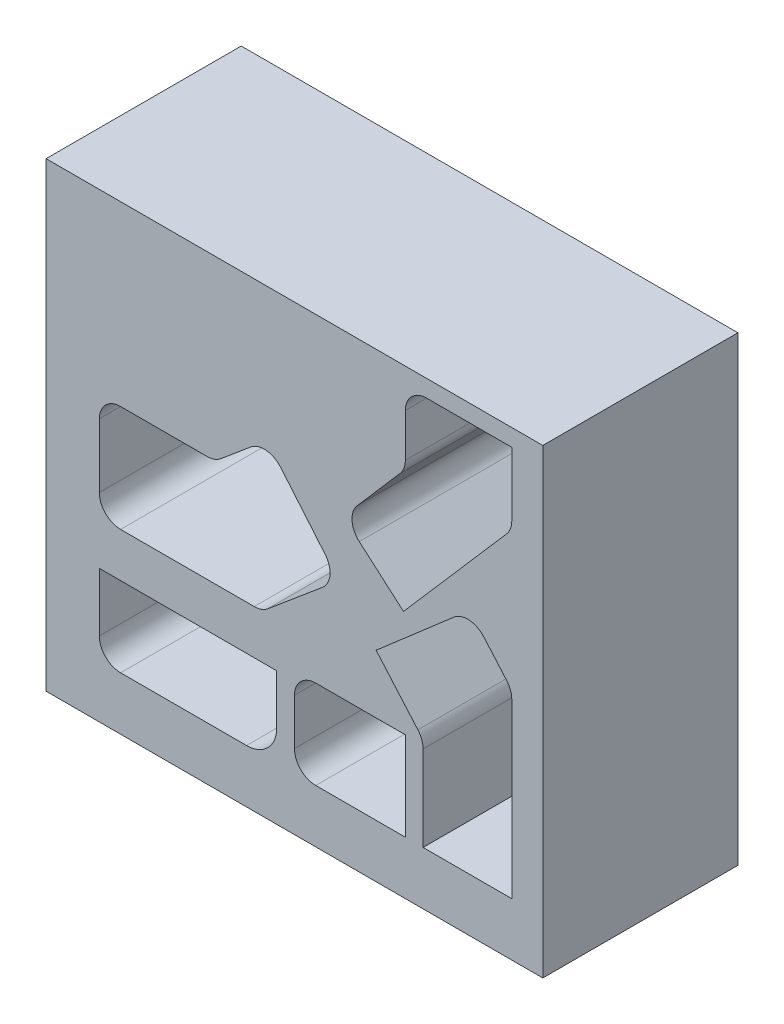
ISO-10303-21;
HEADER;
FILE_DESCRIPTION(('STEP AP214'),'2;1');
FILE_NAME('part.step','',(''),(''),'','','');
FILE_SCHEMA(('AUTOMOTIVE_DESIGN { 1 0 10303 214 1 1 1 1 }'));
ENDSEC;
DATA;
#1=APPLICATION_CONTEXT('core data for automotive mechanical design processes');
#2=APPLICATION_PROTOCOL_DEFINITION('international standard','automotive_design',2000,#1);
#3=PRODUCT_CONTEXT('',#1,'mechanical');
#4=PRODUCT('Part','Part','',(#3));
#5=PRODUCT_RELATED_PRODUCT_CATEGORY('part','',(#4));
#6=PRODUCT_DEFINITION_FORMATION('','',#4);
#7=PRODUCT_DEFINITION_CONTEXT('part definition',#1,'design');
#8=PRODUCT_DEFINITION('design','',#6,#7);
#9=PRODUCT_DEFINITION_SHAPE('','',#8);
#10=(LENGTH_UNIT() NAMED_UNIT(*) SI_UNIT(.MILLI.,.METRE.));
#11=(NAMED_UNIT(*) PLANE_ANGLE_UNIT() SI_UNIT($,.RADIAN.));
#12=(NAMED_UNIT(*) SI_UNIT($,.STERADIAN.) SOLID_ANGLE_UNIT());
#13=UNCERTAINTY_MEASURE_WITH_UNIT(LENGTH_MEASURE(1.E-05),#10,'distance_accuracy_value','');
#14=(GEOMETRIC_REPRESENTATION_CONTEXT(3) GLOBAL_UNCERTAINTY_ASSIGNED_CONTEXT((#13)) GLOBAL_UNIT_ASSIGNED_CONTEXT((#10,
#11,#12)) REPRESENTATION_CONTEXT('',''));
#15=CARTESIAN_POINT('',(0.,0.,0.));
#16=DIRECTION('',(0.,0.,1.));
#17=DIRECTION('',(1.,0.,0.));
#18=AXIS2_PLACEMENT_3D('',#15,#16,#17);
#19=CARTESIAN_POINT('',(-19.05,-19.05,-69.85));
#20=DIRECTION('',(-1.,0.,0.));
#21=DIRECTION('',(0.,0.,1.));
#22=AXIS2_PLACEMENT_3D('',#19,#20,#21);
#23=PLANE('',#22);
#24=DIRECTION('',(0.,-1.,0.));
#25=VECTOR('',#24,1.);
#26=CARTESIAN_POINT('',(-19.05,-19.05,0.));
#27=LINE('',#26,#25);
#28=CARTESIAN_POINT('',(-19.05,146.05,0.));
#29=VERTEX_POINT('',#28);
#30=CARTESIAN_POINT('',(-19.05,-19.05,0.));
#31=VERTEX_POINT('',#30);
#32=EDGE_CURVE('E673',#29,#31,#27,.T.);
#33=ORIENTED_EDGE('',*,*,#32,.F.);
#34=DIRECTION('',(0.,0.,1.));
#35=VECTOR('',#34,1.);
#36=CARTESIAN_POINT('',(-19.05,146.05,-69.85));
#37=LINE('',#36,#35);
#38=CARTESIAN_POINT('',(-19.05,146.05,-69.85));
#39=VERTEX_POINT('',#38);
#40=EDGE_CURVE('E11',#39,#29,#37,.T.);
#41=ORIENTED_EDGE('',*,*,#40,.F.);
#42=DIRECTION('',(0.,-1.,0.));
#43=VECTOR('',#42,1.);
#44=CARTESIAN_POINT('',(-19.05,-19.05,-69.85));
#45=LINE('',#44,#43);
#46=CARTESIAN_POINT('',(-19.05,-19.05,-69.85));
#47=VERTEX_POINT('',#46);
#48=EDGE_CURVE('E684',#39,#47,#45,.T.);
#49=ORIENTED_EDGE('',*,*,#48,.T.);
#50=DIRECTION('',(0.,0.,1.));
#51=VECTOR('',#50,1.);
#52=CARTESIAN_POINT('',(-19.05,-19.05,-69.85));
#53=LINE('',#52,#51);
#54=EDGE_CURVE('E39',#47,#31,#53,.T.);
#55=ORIENTED_EDGE('',*,*,#54,.T.);
#56=EDGE_LOOP('',(#33,#41,#49,#55));
#57=FACE_BOUND('',#56,.T.);
#58=ADVANCED_FACE('F36',(#57),#23,.T.);
#59=CARTESIAN_POINT('',(-19.05,146.05,-69.85));
#60=DIRECTION('',(0.,1.,0.));
#61=DIRECTION('',(0.,0.,1.));
#62=AXIS2_PLACEMENT_3D('',#59,#60,#61);
#63=PLANE('',#62);
#64=DIRECTION('',(-1.,0.,0.));
#65=VECTOR('',#64,1.);
#66=CARTESIAN_POINT('',(-19.05,146.05,0.));
#67=LINE('',#66,#65);
#68=CARTESIAN_POINT('',(158.75,146.05,0.));
#69=VERTEX_POINT('',#68);
#70=EDGE_CURVE('E688',#69,#29,#67,.T.);
#71=ORIENTED_EDGE('',*,*,#70,.F.);
#72=DIRECTION('',(0.,0.,1.));
#73=VECTOR('',#72,1.);
#74=CARTESIAN_POINT('',(158.75,146.05,-69.85));
#75=LINE('',#74,#73);
#76=CARTESIAN_POINT('',(158.75,146.05,-69.85));
#77=VERTEX_POINT('',#76);
#78=EDGE_CURVE('E44',#77,#69,#75,.T.);
#79=ORIENTED_EDGE('',*,*,#78,.F.);
#80=DIRECTION('',(-1.,0.,0.));
#81=VECTOR('',#80,1.);
#82=CARTESIAN_POINT('',(-19.05,146.05,-69.85));
#83=LINE('',#82,#81);
#84=EDGE_CURVE('E694',#77,#39,#83,.T.);
#85=ORIENTED_EDGE('',*,*,#84,.T.);
#86=ORIENTED_EDGE('',*,*,#40,.T.);
#87=EDGE_LOOP('',(#71,#79,#85,#86));
#88=FACE_BOUND('',#87,.T.);
#89=ADVANCED_FACE('F720',(#88),#63,.T.);
#90=CARTESIAN_POINT('',(158.75,-19.05,-69.85));
#91=DIRECTION('',(1.,0.,0.));
#92=DIRECTION('',(0.,0.,-1.));
#93=AXIS2_PLACEMENT_3D('',#90,#91,#92);
#94=PLANE('',#93);
#95=DIRECTION('',(0.,1.,0.));
#96=VECTOR('',#95,1.);
#97=CARTESIAN_POINT('',(158.75,-19.05,0.));
#98=LINE('',#97,#96);
#99=CARTESIAN_POINT('',(158.75,-19.05,0.));
#100=VERTEX_POINT('',#99);
#101=EDGE_CURVE('E702',#100,#69,#98,.T.);
#102=ORIENTED_EDGE('',*,*,#101,.F.);
#103=DIRECTION('',(0.,0.,1.));
#104=VECTOR('',#103,1.);
#105=CARTESIAN_POINT('',(158.75,-19.05,-69.85));
#106=LINE('',#105,#104);
#107=CARTESIAN_POINT('',(158.75,-19.05,-69.85));
#108=VERTEX_POINT('',#107);
#109=EDGE_CURVE('E707',#108,#100,#106,.T.);
#110=ORIENTED_EDGE('',*,*,#109,.F.);
#111=DIRECTION('',(0.,1.,0.));
#112=VECTOR('',#111,1.);
#113=CARTESIAN_POINT('',(158.75,-19.05,-69.85));
#114=LINE('',#113,#112);
#115=EDGE_CURVE('E691',#108,#77,#114,.T.);
#116=ORIENTED_EDGE('',*,*,#115,.T.);
#117=ORIENTED_EDGE('',*,*,#78,.T.);
#118=EDGE_LOOP('',(#102,#110,#116,#117));
#119=FACE_BOUND('',#118,.T.);
#120=ADVANCED_FACE('F725',(#119),#94,.T.);
#121=CARTESIAN_POINT('',(-19.05,-19.05,-69.85));
#122=DIRECTION('',(0.,-1.,0.));
#123=DIRECTION('',(0.,0.,-1.));
#124=AXIS2_PLACEMENT_3D('',#121,#122,#123);
#125=PLANE('',#124);
#126=DIRECTION('',(1.,0.,0.));
#127=VECTOR('',#126,1.);
#128=CARTESIAN_POINT('',(-19.05,-19.05,0.));
#129=LINE('',#128,#127);
#130=EDGE_CURVE('E699',#31,#100,#129,.T.);
#131=ORIENTED_EDGE('',*,*,#130,.F.);
#132=ORIENTED_EDGE('',*,*,#54,.F.);
#133=DIRECTION('',(1.,0.,0.));
#134=VECTOR('',#133,1.);
#135=CARTESIAN_POINT('',(-19.05,-19.05,-69.85));
#136=LINE('',#135,#134);
#137=EDGE_CURVE('E687',#47,#108,#136,.T.);
#138=ORIENTED_EDGE('',*,*,#137,.T.);
#139=ORIENTED_EDGE('',*,*,#109,.T.);
#140=EDGE_LOOP('',(#131,#132,#138,#139));
#141=FACE_BOUND('',#140,.T.);
#142=ADVANCED_FACE('F715',(#141),#125,.T.);
#143=CARTESIAN_POINT('',(0.,0.,-69.85));
#144=DIRECTION('',(0.,0.,-1.));
#145=DIRECTION('',(-1.,0.,0.));
#146=AXIS2_PLACEMENT_3D('',#143,#144,#145);
#147=PLANE('',#146);
#148=CARTESIAN_POINT('',(98.068674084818,89.1498419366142,-69.85));
#149=DIRECTION('',(0.,0.,1.));
#150=DIRECTION('',(1.,0.,0.));
#151=AXIS2_PLACEMENT_3D('',#148,#149,#150);
#152=CIRCLE('',#151,7.62000000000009);
#153=CARTESIAN_POINT('',(92.3153447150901,94.1462007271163,-69.85));
#154=VERTEX_POINT('',#153);
#155=CARTESIAN_POINT('',(93.0723152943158,83.3965125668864,-69.85));
#156=VERTEX_POINT('',#155);
#157=EDGE_CURVE('E337',#154,#156,#152,.T.);
#158=ORIENTED_EDGE('',*,*,#157,.T.);
#159=DIRECTION('',(0.755030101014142,-0.655690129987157,0.));
#160=VECTOR('',#159,1.);
#161=CARTESIAN_POINT('',(93.0723152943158,83.3965125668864,-69.85));
#162=LINE('',#161,#160);
#163=CARTESIAN_POINT('',(108.893971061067,69.6565258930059,-69.85));
#164=VERTEX_POINT('',#163);
#165=EDGE_CURVE('E346',#156,#164,#162,.T.);
#166=ORIENTED_EDGE('',*,*,#165,.T.);
#167=DIRECTION('',(0.655690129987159,0.75503010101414,0.));
#168=VECTOR('',#167,1.);
#169=CARTESIAN_POINT('',(108.893971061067,69.6565258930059,-69.85));
#170=LINE('',#169,#168);
#171=CARTESIAN_POINT('',(145.78740441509,112.139478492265,-69.85));
#172=VERTEX_POINT('',#171);
#173=EDGE_CURVE('E52',#164,#172,#170,.T.);
#174=ORIENTED_EDGE('',*,*,#173,.T.);
#175=CARTESIAN_POINT('',(140.034075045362,117.135837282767,-69.85));
#176=DIRECTION('',(0.,0.,1.));
#177=DIRECTION('',(1.,0.,0.));
#178=AXIS2_PLACEMENT_3D('',#175,#176,#177);
#179=CIRCLE('',#178,7.61999999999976);
#180=CARTESIAN_POINT('',(147.654075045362,117.135837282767,-69.85));
#181=VERTEX_POINT('',#180);
#182=EDGE_CURVE('E361',#172,#181,#179,.T.);
#183=ORIENTED_EDGE('',*,*,#182,.T.);
#184=DIRECTION('',(0.,1.,0.));
#185=VECTOR('',#184,1.);
#186=CARTESIAN_POINT('',(147.654075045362,117.135837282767,-69.85));
#187=LINE('',#186,#185);
#188=CARTESIAN_POINT('',(147.654075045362,139.925756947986,-69.85));
#189=VERTEX_POINT('',#188);
#190=EDGE_CURVE('E364',#181,#189,#187,.T.);
#191=ORIENTED_EDGE('',*,*,#190,.T.);
#192=DIRECTION('',(-1.,0.,0.));
#193=VECTOR('',#192,1.);
#194=CARTESIAN_POINT('',(147.654075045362,139.925756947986,-69.85));
#195=LINE('',#194,#193);
#196=CARTESIAN_POINT('',(117.174075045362,139.925756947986,-69.85));
#197=VERTEX_POINT('',#196);
#198=EDGE_CURVE('E367',#189,#197,#195,.T.);
#199=ORIENTED_EDGE('',*,*,#198,.T.);
#200=CARTESIAN_POINT('',(117.174075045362,132.305756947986,-69.85));
#201=DIRECTION('',(0.,0.,1.));
#202=DIRECTION('',(1.,0.,0.));
#203=AXIS2_PLACEMENT_3D('',#200,#201,#202);
#204=CIRCLE('',#203,7.61999999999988);
#205=CARTESIAN_POINT('',(109.554075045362,132.305756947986,-69.85));
#206=VERTEX_POINT('',#205);
#207=EDGE_CURVE('E370',#197,#206,#204,.T.);
#208=ORIENTED_EDGE('',*,*,#207,.T.);
#209=DIRECTION('',(0.,-1.,0.));
#210=VECTOR('',#209,1.);
#211=CARTESIAN_POINT('',(109.554075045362,132.305756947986,-69.85));
#212=LINE('',#211,#210);
#213=CARTESIAN_POINT('',(109.554075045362,116.843554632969,-69.85));
#214=VERTEX_POINT('',#213);
#215=EDGE_CURVE('E373',#206,#214,#212,.T.);
#216=ORIENTED_EDGE('',*,*,#215,.T.);
#217=CARTESIAN_POINT('',(101.934075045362,116.843554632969,-69.85));
#218=DIRECTION('',(0.,0.,-1.));
#219=DIRECTION('',(1.,0.,0.));
#220=AXIS2_PLACEMENT_3D('',#217,#218,#219);
#221=CIRCLE('',#220,7.61999999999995);
#222=CARTESIAN_POINT('',(107.687404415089,111.847195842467,-69.85));
#223=VERTEX_POINT('',#222);
#224=EDGE_CURVE('E376',#214,#223,#221,.T.);
#225=ORIENTED_EDGE('',*,*,#224,.T.);
#226=DIRECTION('',(-0.655690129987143,-0.755030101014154,0.));
#227=VECTOR('',#226,1.);
#228=CARTESIAN_POINT('',(107.687404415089,111.847195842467,-69.85));
#229=LINE('',#228,#227);
#230=EDGE_CURVE('E343',#223,#154,#229,.T.);
#231=ORIENTED_EDGE('',*,*,#230,.T.);
#232=EDGE_LOOP('',(#158,#166,#174,#183,#191,#199,#208,#216,#225,#231));
#233=FACE_BOUND('',#232,.T.);
#234=DIRECTION('',(0.,-1.,0.));
#235=VECTOR('',#234,1.);
#236=CARTESIAN_POINT('',(115.904075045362,30.5324930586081,-69.85));
#237=LINE('',#236,#235);
#238=CARTESIAN_POINT('',(115.904075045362,30.5324930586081,-69.85));
#239=VERTEX_POINT('',#238);
#240=CARTESIAN_POINT('',(115.904075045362,5.55111512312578E-13,-69.85));
#241=VERTEX_POINT('',#240);
#242=EDGE_CURVE('E420',#239,#241,#237,.T.);
#243=ORIENTED_EDGE('',*,*,#242,.T.);
#244=DIRECTION('',(1.,0.,0.));
#245=VECTOR('',#244,1.);
#246=CARTESIAN_POINT('',(115.904075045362,5.55111512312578E-13,-69.85));
#247=LINE('',#246,#245);
#248=CARTESIAN_POINT('',(147.654075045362,5.55111512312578E-13,-69.85));
#249=VERTEX_POINT('',#248);
#250=EDGE_CURVE('E423',#241,#249,#247,.T.);
#251=ORIENTED_EDGE('',*,*,#250,.T.);
#252=DIRECTION('',(0.,1.,0.));
#253=VECTOR('',#252,1.);
#254=CARTESIAN_POINT('',(147.654075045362,5.55111512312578E-13,-69.85));
#255=LINE('',#254,#253);
#256=CARTESIAN_POINT('',(147.654075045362,61.7633952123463,-69.85));
#257=VERTEX_POINT('',#256);
#258=EDGE_CURVE('E427',#249,#257,#255,.T.);
#259=ORIENTED_EDGE('',*,*,#258,.T.);
#260=CARTESIAN_POINT('',(140.034075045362,61.7633952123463,-69.85));
#261=DIRECTION('',(0.,0.,1.));
#262=DIRECTION('',(1.,0.,0.));
#263=AXIS2_PLACEMENT_3D('',#260,#261,#262);
#264=CIRCLE('',#263,7.61999999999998);
#265=CARTESIAN_POINT('',(145.78740441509,66.7597540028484,-69.85));
#266=VERTEX_POINT('',#265);
#267=EDGE_CURVE('E430',#257,#266,#264,.T.);
#268=ORIENTED_EDGE('',*,*,#267,.T.);
#269=DIRECTION('',(-0.655690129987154,0.755030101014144,0.));
#270=VECTOR('',#269,1.);
#271=CARTESIAN_POINT('',(145.78740441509,66.7597540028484,-69.85));
#272=LINE('',#271,#270);
#273=CARTESIAN_POINT('',(137.651725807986,76.128024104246,-69.85));
#274=VERTEX_POINT('',#273);
#275=EDGE_CURVE('E433',#266,#274,#272,.T.);
#276=ORIENTED_EDGE('',*,*,#275,.T.);
#277=CARTESIAN_POINT('',(131.898396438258,71.1316653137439,-69.85));
#278=DIRECTION('',(0.,0.,1.));
#279=DIRECTION('',(1.,0.,0.));
#280=AXIS2_PLACEMENT_3D('',#277,#278,#279);
#281=CIRCLE('',#280,7.61999999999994);
#282=CARTESIAN_POINT('',(126.902037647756,76.8849946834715,-69.85));
#283=VERTEX_POINT('',#282);
#284=EDGE_CURVE('E436',#274,#283,#281,.T.);
#285=ORIENTED_EDGE('',*,*,#284,.T.);
#286=DIRECTION('',(-0.755030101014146,-0.655690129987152,0.));
#287=VECTOR('',#286,1.);
#288=CARTESIAN_POINT('',(126.902037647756,76.8849946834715,-69.85));
#289=LINE('',#288,#287);
#290=CARTESIAN_POINT('',(99.0942790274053,52.7359271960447,-69.85));
#291=VERTEX_POINT('',#290);
#292=EDGE_CURVE('E439',#283,#291,#289,.T.);
#293=ORIENTED_EDGE('',*,*,#292,.T.);
#294=DIRECTION('',(0.655690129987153,-0.755030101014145,0.));
#295=VECTOR('',#294,1.);
#296=CARTESIAN_POINT('',(99.0942790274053,52.7359271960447,-69.85));
#297=LINE('',#296,#295);
#298=CARTESIAN_POINT('',(114.03740441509,35.5288518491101,-69.85));
#299=VERTEX_POINT('',#298);
#300=EDGE_CURVE('E442',#291,#299,#297,.T.);
#301=ORIENTED_EDGE('',*,*,#300,.T.);
#302=CARTESIAN_POINT('',(108.284075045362,30.5324930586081,-69.85));
#303=DIRECTION('',(0.,0.,-1.));
#304=DIRECTION('',(1.,0.,0.));
#305=AXIS2_PLACEMENT_3D('',#302,#303,#304);
#306=CIRCLE('',#305,7.61999999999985);
#307=EDGE_CURVE('E445',#299,#239,#306,.T.);
#308=ORIENTED_EDGE('',*,*,#307,.T.);
#309=EDGE_LOOP('',(#243,#251,#259,#268,#276,#285,#293,#301,#308));
#310=FACE_BOUND('',#309,.T.);
#311=DIRECTION('',(0.,1.,0.));
#312=VECTOR('',#311,1.);
#313=CARTESIAN_POINT('',(109.554075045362,-4.44089209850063E-13,-69.85));
#314=LINE('',#313,#312);
#315=CARTESIAN_POINT('',(109.554075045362,-4.44089209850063E-13,-69.85));
#316=VERTEX_POINT('',#315);
#317=CARTESIAN_POINT('',(109.554075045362,31.7499999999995,-69.85));
#318=VERTEX_POINT('',#317);
#319=EDGE_CURVE('E492',#316,#318,#314,.T.);
#320=ORIENTED_EDGE('',*,*,#319,.T.);
#321=DIRECTION('',(-1.,0.,0.));
#322=VECTOR('',#321,1.);
#323=CARTESIAN_POINT('',(109.554075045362,31.7499999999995,-69.85));
#324=LINE('',#323,#322);
#325=CARTESIAN_POINT('',(77.4700000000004,31.7499999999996,-69.85));
#326=VERTEX_POINT('',#325);
#327=EDGE_CURVE('E495',#318,#326,#324,.T.);
#328=ORIENTED_EDGE('',*,*,#327,.T.);
#329=CARTESIAN_POINT('',(77.4700000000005,24.1299999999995,-69.85));
#330=DIRECTION('',(0.,0.,1.));
#331=DIRECTION('',(1.,0.,0.));
#332=AXIS2_PLACEMENT_3D('',#329,#330,#331);
#333=CIRCLE('',#332,7.6200000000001);
#334=CARTESIAN_POINT('',(69.8500000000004,24.1299999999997,-69.85));
#335=VERTEX_POINT('',#334);
#336=EDGE_CURVE('E499',#326,#335,#333,.T.);
#337=ORIENTED_EDGE('',*,*,#336,.T.);
#338=DIRECTION('',(0.,-1.,0.));
#339=VECTOR('',#338,1.);
#340=CARTESIAN_POINT('',(69.8500000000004,24.1299999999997,-69.85));
#341=LINE('',#340,#339);
#342=CARTESIAN_POINT('',(69.8500000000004,7.61999999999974,-69.85));
#343=VERTEX_POINT('',#342);
#344=EDGE_CURVE('E502',#335,#343,#341,.T.);
#345=ORIENTED_EDGE('',*,*,#344,.T.);
#346=CARTESIAN_POINT('',(77.4700000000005,7.61999999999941,-69.85));
#347=DIRECTION('',(0.,0.,1.));
#348=DIRECTION('',(1.,0.,0.));
#349=AXIS2_PLACEMENT_3D('',#346,#347,#348);
#350=CIRCLE('',#349,7.61999999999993);
#351=CARTESIAN_POINT('',(77.4700000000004,-5.27355936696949E-13,-69.85));
#352=VERTEX_POINT('',#351);
#353=EDGE_CURVE('E505',#343,#352,#350,.T.);
#354=ORIENTED_EDGE('',*,*,#353,.T.);
#355=DIRECTION('',(1.,0.,0.));
#356=VECTOR('',#355,1.);
#357=CARTESIAN_POINT('',(77.4700000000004,-3.88578058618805E-13,-69.85));
#358=LINE('',#357,#356);
#359=EDGE_CURVE('E508',#352,#316,#358,.T.);
#360=ORIENTED_EDGE('',*,*,#359,.T.);
#361=EDGE_LOOP('',(#320,#328,#337,#345,#354,#360));
#362=FACE_BOUND('',#361,.T.);
#363=CARTESIAN_POINT('',(59.0710646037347,87.4320250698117,-69.85));
#364=DIRECTION('',(0.,0.,1.));
#365=DIRECTION('',(1.,0.,0.));
#366=AXIS2_PLACEMENT_3D('',#363,#364,#365);
#367=CIRCLE('',#366,7.61999999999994);
#368=CARTESIAN_POINT('',(64.9083232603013,92.3300666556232,-69.85));
#369=VERTEX_POINT('',#368);
#370=CARTESIAN_POINT('',(54.1730230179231,93.2692837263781,-69.85));
#371=VERTEX_POINT('',#370);
#372=EDGE_CURVE('E540',#369,#371,#367,.T.);
#373=ORIENTED_EDGE('',*,*,#372,.T.);
#374=DIRECTION('',(-0.766044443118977,-0.64278760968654,0.));
#375=VECTOR('',#374,1.);
#376=CARTESIAN_POINT('',(54.1730230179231,93.2692837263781,-69.85));
#377=LINE('',#376,#375);
#378=CARTESIAN_POINT('',(43.5228665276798,84.3327413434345,-69.85));
#379=VERTEX_POINT('',#378);
#380=EDGE_CURVE('E543',#371,#379,#377,.T.);
#381=ORIENTED_EDGE('',*,*,#380,.T.);
#382=CARTESIAN_POINT('',(38.6248249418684,90.1700000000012,-69.85));
#383=DIRECTION('',(0.,0.,-1.));
#384=DIRECTION('',(1.,0.,0.));
#385=AXIS2_PLACEMENT_3D('',#382,#383,#384);
#386=CIRCLE('',#385,7.61999999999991);
#387=CARTESIAN_POINT('',(38.6248249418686,82.5500000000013,-69.85));
#388=VERTEX_POINT('',#387);
#389=EDGE_CURVE('E547',#379,#388,#386,.T.);
#390=ORIENTED_EDGE('',*,*,#389,.T.);
#391=DIRECTION('',(-1.,0.,0.));
#392=VECTOR('',#391,1.);
#393=CARTESIAN_POINT('',(38.6248249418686,82.5500000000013,-69.85));
#394=LINE('',#393,#392);
#395=CARTESIAN_POINT('',(7.61999999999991,82.550000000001,-69.85));
#396=VERTEX_POINT('',#395);
#397=EDGE_CURVE('E550',#388,#396,#394,.T.);
#398=ORIENTED_EDGE('',*,*,#397,.T.);
#399=CARTESIAN_POINT('',(7.61999999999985,74.9300000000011,-69.85));
#400=DIRECTION('',(0.,0.,1.));
#401=DIRECTION('',(1.,0.,0.));
#402=AXIS2_PLACEMENT_3D('',#399,#400,#401);
#403=CIRCLE('',#402,7.61999999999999);
#404=CARTESIAN_POINT('',(0.,74.9300000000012,-69.85));
#405=VERTEX_POINT('',#404);
#406=EDGE_CURVE('E553',#396,#405,#403,.T.);
#407=ORIENTED_EDGE('',*,*,#406,.T.);
#408=DIRECTION('',(0.,-1.,0.));
#409=VECTOR('',#408,1.);
#410=CARTESIAN_POINT('',(0.,74.9300000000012,-69.85));
#411=LINE('',#410,#409);
#412=CARTESIAN_POINT('',(-1.11022302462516E-13,52.0700000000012,-69.85));
#413=VERTEX_POINT('',#412);
#414=EDGE_CURVE('E556',#405,#413,#411,.T.);
#415=ORIENTED_EDGE('',*,*,#414,.T.);
#416=CARTESIAN_POINT('',(7.61999999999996,52.0700000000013,-69.85));
#417=DIRECTION('',(0.,0.,1.));
#418=DIRECTION('',(1.,0.,0.));
#419=AXIS2_PLACEMENT_3D('',#416,#417,#418);
#420=CIRCLE('',#419,7.62000000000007);
#421=CARTESIAN_POINT('',(7.62000000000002,44.4500000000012,-69.85));
#422=VERTEX_POINT('',#421);
#423=EDGE_CURVE('E559',#413,#422,#420,.T.);
#424=ORIENTED_EDGE('',*,*,#423,.T.);
#425=DIRECTION('',(1.,0.,0.));
#426=VECTOR('',#425,1.);
#427=CARTESIAN_POINT('',(7.62000000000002,44.4500000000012,-69.85));
#428=LINE('',#427,#426);
#429=CARTESIAN_POINT('',(55.4557447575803,44.4500000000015,-69.85));
#430=VERTEX_POINT('',#429);
#431=EDGE_CURVE('E562',#422,#430,#428,.T.);
#432=ORIENTED_EDGE('',*,*,#431,.T.);
#433=CARTESIAN_POINT('',(55.4557447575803,52.0700000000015,-69.85));
#434=DIRECTION('',(0.,0.,1.));
#435=DIRECTION('',(1.,0.,0.));
#436=AXIS2_PLACEMENT_3D('',#433,#434,#435);
#437=CIRCLE('',#436,7.62000000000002);
#438=CARTESIAN_POINT('',(60.3537863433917,46.2327413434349,-69.85));
#439=VERTEX_POINT('',#438);
#440=EDGE_CURVE('E565',#430,#439,#437,.T.);
#441=ORIENTED_EDGE('',*,*,#440,.T.);
#442=DIRECTION('',(0.766044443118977,0.642787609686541,0.));
#443=VECTOR('',#442,1.);
#444=CARTESIAN_POINT('',(60.3537863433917,46.2327413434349,-69.85));
#445=LINE('',#444,#443);
#446=CARTESIAN_POINT('',(79.8877413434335,62.6236757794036,-69.85));
#447=VERTEX_POINT('',#446);
#448=EDGE_CURVE('E568',#439,#447,#445,.T.);
#449=ORIENTED_EDGE('',*,*,#448,.T.);
#450=CARTESIAN_POINT('',(74.989699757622,68.4609344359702,-69.85));
#451=DIRECTION('',(0.,0.,1.));
#452=DIRECTION('',(1.,0.,0.));
#453=AXIS2_PLACEMENT_3D('',#450,#451,#452);
#454=CIRCLE('',#453,7.61999999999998);
#455=CARTESIAN_POINT('',(80.8269584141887,73.3589760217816,-69.85));
#456=VERTEX_POINT('',#455);
#457=EDGE_CURVE('E571',#447,#456,#454,.T.);
#458=ORIENTED_EDGE('',*,*,#457,.T.);
#459=DIRECTION('',(-0.642787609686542,0.766044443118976,0.));
#460=VECTOR('',#459,1.);
#461=CARTESIAN_POINT('',(80.8269584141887,73.3589760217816,-69.85));
#462=LINE('',#461,#460);
#463=EDGE_CURVE('E574',#456,#369,#462,.T.);
#464=ORIENTED_EDGE('',*,*,#463,.T.);
#465=EDGE_LOOP('',(#373,#381,#390,#398,#407,#415,#424,#432,#441,#449,#458,#464));
#466=FACE_BOUND('',#465,.T.);
#467=CARTESIAN_POINT('',(7.62000000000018,7.62000000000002,-69.85));
#468=DIRECTION('',(0.,0.,1.));
#469=DIRECTION('',(1.,0.,0.));
#470=AXIS2_PLACEMENT_3D('',#467,#468,#469);
#471=CIRCLE('',#470,7.6200000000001);
#472=CARTESIAN_POINT('',(0.,7.61999999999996,-69.85));
#473=VERTEX_POINT('',#472);
#474=CARTESIAN_POINT('',(7.62000000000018,0.,-69.85));
#475=VERTEX_POINT('',#474);
#476=EDGE_CURVE('E636',#473,#475,#471,.T.);
#477=ORIENTED_EDGE('',*,*,#476,.T.);
#478=DIRECTION('',(1.,0.,0.));
#479=VECTOR('',#478,1.);
#480=CARTESIAN_POINT('',(7.62000000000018,0.,-69.85));
#481=LINE('',#480,#479);
#482=CARTESIAN_POINT('',(52.7050000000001,0.,-69.85));
#483=VERTEX_POINT('',#482);
#484=EDGE_CURVE('E639',#475,#483,#481,.T.);
#485=ORIENTED_EDGE('',*,*,#484,.T.);
#486=CARTESIAN_POINT('',(52.7050000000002,10.7950000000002,-69.85));
#487=DIRECTION('',(0.,0.,1.));
#488=DIRECTION('',(1.,0.,0.));
#489=AXIS2_PLACEMENT_3D('',#486,#487,#488);
#490=CIRCLE('',#489,10.7950000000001);
#491=CARTESIAN_POINT('',(63.5000000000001,10.7949999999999,-69.85));
#492=VERTEX_POINT('',#491);
#493=EDGE_CURVE('E643',#483,#492,#490,.T.);
#494=ORIENTED_EDGE('',*,*,#493,.T.);
#495=DIRECTION('',(0.,1.,0.));
#496=VECTOR('',#495,1.);
#497=CARTESIAN_POINT('',(63.5000000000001,10.7949999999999,-69.85));
#498=LINE('',#497,#496);
#499=CARTESIAN_POINT('',(63.5000000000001,28.5750000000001,-69.85));
#500=VERTEX_POINT('',#499);
#501=EDGE_CURVE('E646',#492,#500,#498,.T.);
#502=ORIENTED_EDGE('',*,*,#501,.T.);
#503=DIRECTION('',(-1.,0.,0.));
#504=VECTOR('',#503,1.);
#505=CARTESIAN_POINT('',(63.5000000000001,28.5750000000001,-69.85));
#506=LINE('',#505,#504);
#507=CARTESIAN_POINT('',(0.,28.5750000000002,-69.85));
#508=VERTEX_POINT('',#507);
#509=EDGE_CURVE('E649',#500,#508,#506,.T.);
#510=ORIENTED_EDGE('',*,*,#509,.T.);
#511=DIRECTION('',(0.,-1.,0.));
#512=VECTOR('',#511,1.);
#513=CARTESIAN_POINT('',(0.,28.5750000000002,-69.85));
#514=LINE('',#513,#512);
#515=EDGE_CURVE('E652',#508,#473,#514,.T.);
#516=ORIENTED_EDGE('',*,*,#515,.T.);
#517=EDGE_LOOP('',(#477,#485,#494,#502,#510,#516));
#518=FACE_BOUND('',#517,.T.);
#519=ORIENTED_EDGE('',*,*,#48,.F.);
#520=ORIENTED_EDGE('',*,*,#84,.F.);
#521=ORIENTED_EDGE('',*,*,#115,.F.);
#522=ORIENTED_EDGE('',*,*,#137,.F.);
#523=EDGE_LOOP('',(#519,#520,#521,#522));
#524=FACE_BOUND('',#523,.T.);
#525=ADVANCED_FACE('F350',(#233,#310,#362,#466,#518,#524),#147,.T.);
#526=CARTESIAN_POINT('',(0.,0.,0.));
#527=DIRECTION('',(0.,0.,-1.));
#528=DIRECTION('',(-1.,0.,0.));
#529=AXIS2_PLACEMENT_3D('',#526,#527,#528);
#530=PLANE('',#529);
#531=DIRECTION('',(0.755030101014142,-0.655690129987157,0.));
#532=VECTOR('',#531,1.);
#533=CARTESIAN_POINT('',(93.0723152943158,83.3965125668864,0.));
#534=LINE('',#533,#532);
#535=CARTESIAN_POINT('',(93.0723152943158,83.3965125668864,0.));
#536=VERTEX_POINT('',#535);
#537=CARTESIAN_POINT('',(108.893971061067,69.6565258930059,0.));
#538=VERTEX_POINT('',#537);
#539=EDGE_CURVE('E380',#536,#538,#534,.T.);
#540=ORIENTED_EDGE('',*,*,#539,.F.);
#541=CARTESIAN_POINT('',(98.068674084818,89.1498419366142,0.));
#542=DIRECTION('',(0.,0.,1.));
#543=DIRECTION('',(1.,0.,0.));
#544=AXIS2_PLACEMENT_3D('',#541,#542,#543);
#545=CIRCLE('',#544,7.62000000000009);
#546=CARTESIAN_POINT('',(92.3153447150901,94.1462007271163,0.));
#547=VERTEX_POINT('',#546);
#548=EDGE_CURVE('E60',#547,#536,#545,.T.);
#549=ORIENTED_EDGE('',*,*,#548,.F.);
#550=DIRECTION('',(-0.655690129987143,-0.755030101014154,0.));
#551=VECTOR('',#550,1.);
#552=CARTESIAN_POINT('',(107.687404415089,111.847195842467,0.));
#553=LINE('',#552,#551);
#554=CARTESIAN_POINT('',(107.687404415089,111.847195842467,0.));
#555=VERTEX_POINT('',#554);
#556=EDGE_CURVE('E354',#555,#547,#553,.T.);
#557=ORIENTED_EDGE('',*,*,#556,.F.);
#558=CARTESIAN_POINT('',(101.934075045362,116.843554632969,0.));
#559=DIRECTION('',(0.,0.,-1.));
#560=DIRECTION('',(1.,0.,0.));
#561=AXIS2_PLACEMENT_3D('',#558,#559,#560);
#562=CIRCLE('',#561,7.61999999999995);
#563=CARTESIAN_POINT('',(109.554075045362,116.843554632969,0.));
#564=VERTEX_POINT('',#563);
#565=EDGE_CURVE('E357',#564,#555,#562,.T.);
#566=ORIENTED_EDGE('',*,*,#565,.F.);
#567=DIRECTION('',(0.,-1.,0.));
#568=VECTOR('',#567,1.);
#569=CARTESIAN_POINT('',(109.554075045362,132.305756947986,0.));
#570=LINE('',#569,#568);
#571=CARTESIAN_POINT('',(109.554075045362,132.305756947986,0.));
#572=VERTEX_POINT('',#571);
#573=EDGE_CURVE('E397',#572,#564,#570,.T.);
#574=ORIENTED_EDGE('',*,*,#573,.F.);
#575=CARTESIAN_POINT('',(117.174075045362,132.305756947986,0.));
#576=DIRECTION('',(0.,0.,1.));
#577=DIRECTION('',(1.,0.,0.));
#578=AXIS2_PLACEMENT_3D('',#575,#576,#577);
#579=CIRCLE('',#578,7.61999999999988);
#580=CARTESIAN_POINT('',(117.174075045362,139.925756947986,0.));
#581=VERTEX_POINT('',#580);
#582=EDGE_CURVE('E394',#581,#572,#579,.T.);
#583=ORIENTED_EDGE('',*,*,#582,.F.);
#584=DIRECTION('',(-1.,0.,0.));
#585=VECTOR('',#584,1.);
#586=CARTESIAN_POINT('',(147.654075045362,139.925756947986,0.));
#587=LINE('',#586,#585);
#588=CARTESIAN_POINT('',(147.654075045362,139.925756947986,0.));
#589=VERTEX_POINT('',#588);
#590=EDGE_CURVE('E391',#589,#581,#587,.T.);
#591=ORIENTED_EDGE('',*,*,#590,.F.);
#592=DIRECTION('',(0.,1.,0.));
#593=VECTOR('',#592,1.);
#594=CARTESIAN_POINT('',(147.654075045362,117.135837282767,0.));
#595=LINE('',#594,#593);
#596=CARTESIAN_POINT('',(147.654075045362,117.135837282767,0.));
#597=VERTEX_POINT('',#596);
#598=EDGE_CURVE('E388',#597,#589,#595,.T.);
#599=ORIENTED_EDGE('',*,*,#598,.F.);
#600=CARTESIAN_POINT('',(140.034075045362,117.135837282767,0.));
#601=DIRECTION('',(0.,0.,1.));
#602=DIRECTION('',(1.,0.,0.));
#603=AXIS2_PLACEMENT_3D('',#600,#601,#602);
#604=CIRCLE('',#603,7.61999999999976);
#605=CARTESIAN_POINT('',(145.78740441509,112.139478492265,0.));
#606=VERTEX_POINT('',#605);
#607=EDGE_CURVE('E385',#606,#597,#604,.T.);
#608=ORIENTED_EDGE('',*,*,#607,.F.);
#609=DIRECTION('',(0.655690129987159,0.75503010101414,0.));
#610=VECTOR('',#609,1.);
#611=CARTESIAN_POINT('',(108.893971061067,69.6565258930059,0.));
#612=LINE('',#611,#610);
#613=EDGE_CURVE('E382',#538,#606,#612,.T.);
#614=ORIENTED_EDGE('',*,*,#613,.F.);
#615=EDGE_LOOP('',(#540,#549,#557,#566,#574,#583,#591,#599,#608,#614));
#616=FACE_BOUND('',#615,.T.);
#617=DIRECTION('',(1.,0.,0.));
#618=VECTOR('',#617,1.);
#619=CARTESIAN_POINT('',(115.904075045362,5.55111512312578E-13,0.));
#620=LINE('',#619,#618);
#621=CARTESIAN_POINT('',(115.904075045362,5.55111512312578E-13,0.));
#622=VERTEX_POINT('',#621);
#623=CARTESIAN_POINT('',(147.654075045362,5.55111512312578E-13,0.));
#624=VERTEX_POINT('',#623);
#625=EDGE_CURVE('E450',#622,#624,#620,.T.);
#626=ORIENTED_EDGE('',*,*,#625,.F.);
#627=DIRECTION('',(0.,-1.,0.));
#628=VECTOR('',#627,1.);
#629=CARTESIAN_POINT('',(115.904075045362,30.5324930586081,0.));
#630=LINE('',#629,#628);
#631=CARTESIAN_POINT('',(115.904075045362,30.5324930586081,0.));
#632=VERTEX_POINT('',#631);
#633=EDGE_CURVE('E404',#632,#622,#630,.T.);
#634=ORIENTED_EDGE('',*,*,#633,.F.);
#635=CARTESIAN_POINT('',(108.284075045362,30.5324930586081,0.));
#636=DIRECTION('',(0.,0.,-1.));
#637=DIRECTION('',(1.,0.,0.));
#638=AXIS2_PLACEMENT_3D('',#635,#636,#637);
#639=CIRCLE('',#638,7.61999999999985);
#640=CARTESIAN_POINT('',(114.03740441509,35.5288518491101,0.));
#641=VERTEX_POINT('',#640);
#642=EDGE_CURVE('E424',#641,#632,#639,.T.);
#643=ORIENTED_EDGE('',*,*,#642,.F.);
#644=DIRECTION('',(0.655690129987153,-0.755030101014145,0.));
#645=VECTOR('',#644,1.);
#646=CARTESIAN_POINT('',(99.0942790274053,52.7359271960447,0.));
#647=LINE('',#646,#645);
#648=CARTESIAN_POINT('',(99.0942790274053,52.7359271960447,0.));
#649=VERTEX_POINT('',#648);
#650=EDGE_CURVE('E468',#649,#641,#647,.T.);
#651=ORIENTED_EDGE('',*,*,#650,.F.);
#652=DIRECTION('',(-0.755030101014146,-0.655690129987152,0.));
#653=VECTOR('',#652,1.);
#654=CARTESIAN_POINT('',(126.902037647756,76.8849946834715,0.));
#655=LINE('',#654,#653);
#656=CARTESIAN_POINT('',(126.902037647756,76.8849946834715,0.));
#657=VERTEX_POINT('',#656);
#658=EDGE_CURVE('E465',#657,#649,#655,.T.);
#659=ORIENTED_EDGE('',*,*,#658,.F.);
#660=CARTESIAN_POINT('',(131.898396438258,71.1316653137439,0.));
#661=DIRECTION('',(0.,0.,1.));
#662=DIRECTION('',(1.,0.,0.));
#663=AXIS2_PLACEMENT_3D('',#660,#661,#662);
#664=CIRCLE('',#663,7.61999999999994);
#665=CARTESIAN_POINT('',(137.651725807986,76.128024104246,0.));
#666=VERTEX_POINT('',#665);
#667=EDGE_CURVE('E462',#666,#657,#664,.T.);
#668=ORIENTED_EDGE('',*,*,#667,.F.);
#669=DIRECTION('',(-0.655690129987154,0.755030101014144,0.));
#670=VECTOR('',#669,1.);
#671=CARTESIAN_POINT('',(145.78740441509,66.7597540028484,0.));
#672=LINE('',#671,#670);
#673=CARTESIAN_POINT('',(145.78740441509,66.7597540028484,0.));
#674=VERTEX_POINT('',#673);
#675=EDGE_CURVE('E459',#674,#666,#672,.T.);
#676=ORIENTED_EDGE('',*,*,#675,.F.);
#677=CARTESIAN_POINT('',(140.034075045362,61.7633952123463,0.));
#678=DIRECTION('',(0.,0.,1.));
#679=DIRECTION('',(1.,0.,0.));
#680=AXIS2_PLACEMENT_3D('',#677,#678,#679);
#681=CIRCLE('',#680,7.61999999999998);
#682=CARTESIAN_POINT('',(147.654075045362,61.7633952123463,0.));
#683=VERTEX_POINT('',#682);
#684=EDGE_CURVE('E456',#683,#674,#681,.T.);
#685=ORIENTED_EDGE('',*,*,#684,.F.);
#686=DIRECTION('',(0.,1.,0.));
#687=VECTOR('',#686,1.);
#688=CARTESIAN_POINT('',(147.654075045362,5.55111512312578E-13,0.));
#689=LINE('',#688,#687);
#690=EDGE_CURVE('E453',#624,#683,#689,.T.);
#691=ORIENTED_EDGE('',*,*,#690,.F.);
#692=EDGE_LOOP('',(#626,#634,#643,#651,#659,#668,#676,#685,#691));
#693=FACE_BOUND('',#692,.T.);
#694=DIRECTION('',(-1.,0.,0.));
#695=VECTOR('',#694,1.);
#696=CARTESIAN_POINT('',(109.554075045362,31.7499999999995,0.));
#697=LINE('',#696,#695);
#698=CARTESIAN_POINT('',(109.554075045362,31.7499999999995,0.));
#699=VERTEX_POINT('',#698);
#700=CARTESIAN_POINT('',(77.4700000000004,31.7499999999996,0.));
#701=VERTEX_POINT('',#700);
#702=EDGE_CURVE('E513',#699,#701,#697,.T.);
#703=ORIENTED_EDGE('',*,*,#702,.F.);
#704=DIRECTION('',(0.,1.,0.));
#705=VECTOR('',#704,1.);
#706=CARTESIAN_POINT('',(109.554075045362,-4.44089209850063E-13,0.));
#707=LINE('',#706,#705);
#708=CARTESIAN_POINT('',(109.554075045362,-4.44089209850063E-13,0.));
#709=VERTEX_POINT('',#708);
#710=EDGE_CURVE('E475',#709,#699,#707,.T.);
#711=ORIENTED_EDGE('',*,*,#710,.F.);
#712=DIRECTION('',(1.,0.,0.));
#713=VECTOR('',#712,1.);
#714=CARTESIAN_POINT('',(77.4700000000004,-3.88578058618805E-13,0.));
#715=LINE('',#714,#713);
#716=CARTESIAN_POINT('',(77.4700000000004,-5.27355936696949E-13,0.));
#717=VERTEX_POINT('',#716);
#718=EDGE_CURVE('E496',#717,#709,#715,.T.);
#719=ORIENTED_EDGE('',*,*,#718,.F.);
#720=CARTESIAN_POINT('',(77.4700000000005,7.61999999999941,0.));
#721=DIRECTION('',(0.,0.,1.));
#722=DIRECTION('',(1.,0.,0.));
#723=AXIS2_PLACEMENT_3D('',#720,#721,#722);
#724=CIRCLE('',#723,7.61999999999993);
#725=CARTESIAN_POINT('',(69.8500000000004,7.61999999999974,0.));
#726=VERTEX_POINT('',#725);
#727=EDGE_CURVE('E522',#726,#717,#724,.T.);
#728=ORIENTED_EDGE('',*,*,#727,.F.);
#729=DIRECTION('',(0.,-1.,0.));
#730=VECTOR('',#729,1.);
#731=CARTESIAN_POINT('',(69.8500000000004,24.1299999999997,0.));
#732=LINE('',#731,#730);
#733=CARTESIAN_POINT('',(69.8500000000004,24.1299999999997,0.));
#734=VERTEX_POINT('',#733);
#735=EDGE_CURVE('E519',#734,#726,#732,.T.);
#736=ORIENTED_EDGE('',*,*,#735,.F.);
#737=CARTESIAN_POINT('',(77.4700000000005,24.1299999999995,0.));
#738=DIRECTION('',(0.,0.,1.));
#739=DIRECTION('',(1.,0.,0.));
#740=AXIS2_PLACEMENT_3D('',#737,#738,#739);
#741=CIRCLE('',#740,7.6200000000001);
#742=EDGE_CURVE('E516',#701,#734,#741,.T.);
#743=ORIENTED_EDGE('',*,*,#742,.F.);
#744=EDGE_LOOP('',(#703,#711,#719,#728,#736,#743));
#745=FACE_BOUND('',#744,.T.);
#746=DIRECTION('',(-0.766044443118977,-0.64278760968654,0.));
#747=VECTOR('',#746,1.);
#748=CARTESIAN_POINT('',(54.1730230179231,93.2692837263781,0.));
#749=LINE('',#748,#747);
#750=CARTESIAN_POINT('',(54.1730230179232,93.2692837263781,0.));
#751=VERTEX_POINT('',#750);
#752=CARTESIAN_POINT('',(43.5228665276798,84.3327413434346,0.));
#753=VERTEX_POINT('',#752);
#754=EDGE_CURVE('E579',#751,#753,#749,.T.);
#755=ORIENTED_EDGE('',*,*,#754,.F.);
#756=CARTESIAN_POINT('',(59.0710646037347,87.4320250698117,0.));
#757=DIRECTION('',(0.,0.,1.));
#758=DIRECTION('',(1.,0.,0.));
#759=AXIS2_PLACEMENT_3D('',#756,#757,#758);
#760=CIRCLE('',#759,7.61999999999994);
#761=CARTESIAN_POINT('',(64.9083232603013,92.3300666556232,0.));
#762=VERTEX_POINT('',#761);
#763=EDGE_CURVE('E529',#762,#751,#760,.T.);
#764=ORIENTED_EDGE('',*,*,#763,.F.);
#765=DIRECTION('',(-0.642787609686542,0.766044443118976,0.));
#766=VECTOR('',#765,1.);
#767=CARTESIAN_POINT('',(80.8269584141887,73.3589760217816,0.));
#768=LINE('',#767,#766);
#769=CARTESIAN_POINT('',(80.8269584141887,73.3589760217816,0.));
#770=VERTEX_POINT('',#769);
#771=EDGE_CURVE('E544',#770,#762,#768,.T.);
#772=ORIENTED_EDGE('',*,*,#771,.F.);
#773=CARTESIAN_POINT('',(74.989699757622,68.4609344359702,0.));
#774=DIRECTION('',(0.,0.,1.));
#775=DIRECTION('',(1.,0.,0.));
#776=AXIS2_PLACEMENT_3D('',#773,#774,#775);
#777=CIRCLE('',#776,7.61999999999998);
#778=CARTESIAN_POINT('',(79.8877413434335,62.6236757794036,0.));
#779=VERTEX_POINT('',#778);
#780=EDGE_CURVE('E606',#779,#770,#777,.T.);
#781=ORIENTED_EDGE('',*,*,#780,.F.);
#782=DIRECTION('',(0.766044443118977,0.642787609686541,0.));
#783=VECTOR('',#782,1.);
#784=CARTESIAN_POINT('',(60.3537863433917,46.2327413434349,0.));
#785=LINE('',#784,#783);
#786=CARTESIAN_POINT('',(60.3537863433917,46.2327413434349,0.));
#787=VERTEX_POINT('',#786);
#788=EDGE_CURVE('E603',#787,#779,#785,.T.);
#789=ORIENTED_EDGE('',*,*,#788,.F.);
#790=CARTESIAN_POINT('',(55.4557447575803,52.0700000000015,0.));
#791=DIRECTION('',(0.,0.,1.));
#792=DIRECTION('',(1.,0.,0.));
#793=AXIS2_PLACEMENT_3D('',#790,#791,#792);
#794=CIRCLE('',#793,7.62000000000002);
#795=CARTESIAN_POINT('',(55.4557447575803,44.4500000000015,0.));
#796=VERTEX_POINT('',#795);
#797=EDGE_CURVE('E600',#796,#787,#794,.T.);
#798=ORIENTED_EDGE('',*,*,#797,.F.);
#799=DIRECTION('',(1.,0.,0.));
#800=VECTOR('',#799,1.);
#801=CARTESIAN_POINT('',(7.62000000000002,44.4500000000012,0.));
#802=LINE('',#801,#800);
#803=CARTESIAN_POINT('',(7.62000000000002,44.4500000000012,0.));
#804=VERTEX_POINT('',#803);
#805=EDGE_CURVE('E597',#804,#796,#802,.T.);
#806=ORIENTED_EDGE('',*,*,#805,.F.);
#807=CARTESIAN_POINT('',(7.61999999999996,52.0700000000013,0.));
#808=DIRECTION('',(0.,0.,1.));
#809=DIRECTION('',(1.,0.,0.));
#810=AXIS2_PLACEMENT_3D('',#807,#808,#809);
#811=CIRCLE('',#810,7.62000000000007);
#812=CARTESIAN_POINT('',(-1.11022302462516E-13,52.0700000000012,0.));
#813=VERTEX_POINT('',#812);
#814=EDGE_CURVE('E594',#813,#804,#811,.T.);
#815=ORIENTED_EDGE('',*,*,#814,.F.);
#816=DIRECTION('',(0.,-1.,0.));
#817=VECTOR('',#816,1.);
#818=CARTESIAN_POINT('',(0.,74.9300000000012,0.));
#819=LINE('',#818,#817);
#820=CARTESIAN_POINT('',(0.,74.9300000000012,0.));
#821=VERTEX_POINT('',#820);
#822=EDGE_CURVE('E591',#821,#813,#819,.T.);
#823=ORIENTED_EDGE('',*,*,#822,.F.);
#824=CARTESIAN_POINT('',(7.61999999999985,74.9300000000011,0.));
#825=DIRECTION('',(0.,0.,1.));
#826=DIRECTION('',(1.,0.,0.));
#827=AXIS2_PLACEMENT_3D('',#824,#825,#826);
#828=CIRCLE('',#827,7.61999999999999);
#829=CARTESIAN_POINT('',(7.61999999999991,82.550000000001,0.));
#830=VERTEX_POINT('',#829);
#831=EDGE_CURVE('E588',#830,#821,#828,.T.);
#832=ORIENTED_EDGE('',*,*,#831,.F.);
#833=DIRECTION('',(-1.,0.,0.));
#834=VECTOR('',#833,1.);
#835=CARTESIAN_POINT('',(38.6248249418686,82.5500000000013,0.));
#836=LINE('',#835,#834);
#837=CARTESIAN_POINT('',(38.6248249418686,82.5500000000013,0.));
#838=VERTEX_POINT('',#837);
#839=EDGE_CURVE('E585',#838,#830,#836,.T.);
#840=ORIENTED_EDGE('',*,*,#839,.F.);
#841=CARTESIAN_POINT('',(38.6248249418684,90.1700000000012,0.));
#842=DIRECTION('',(0.,0.,-1.));
#843=DIRECTION('',(1.,0.,0.));
#844=AXIS2_PLACEMENT_3D('',#841,#842,#843);
#845=CIRCLE('',#844,7.61999999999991);
#846=EDGE_CURVE('E582',#753,#838,#845,.T.);
#847=ORIENTED_EDGE('',*,*,#846,.F.);
#848=EDGE_LOOP('',(#755,#764,#772,#781,#789,#798,#806,#815,#823,#832,#840,#847));
#849=FACE_BOUND('',#848,.T.);
#850=DIRECTION('',(1.,0.,0.));
#851=VECTOR('',#850,1.);
#852=CARTESIAN_POINT('',(7.62000000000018,0.,0.));
#853=LINE('',#852,#851);
#854=CARTESIAN_POINT('',(7.62000000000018,0.,0.));
#855=VERTEX_POINT('',#854);
#856=CARTESIAN_POINT('',(52.7050000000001,1.11022302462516E-13,0.));
#857=VERTEX_POINT('',#856);
#858=EDGE_CURVE('E657',#855,#857,#853,.T.);
#859=ORIENTED_EDGE('',*,*,#858,.F.);
#860=CARTESIAN_POINT('',(7.62000000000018,7.62000000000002,0.));
#861=DIRECTION('',(0.,0.,1.));
#862=DIRECTION('',(1.,0.,0.));
#863=AXIS2_PLACEMENT_3D('',#860,#861,#862);
#864=CIRCLE('',#863,7.6200000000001);
#865=CARTESIAN_POINT('',(0.,7.61999999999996,0.));
#866=VERTEX_POINT('',#865);
#867=EDGE_CURVE('E613',#866,#855,#864,.T.);
#868=ORIENTED_EDGE('',*,*,#867,.F.);
#869=DIRECTION('',(0.,-1.,0.));
#870=VECTOR('',#869,1.);
#871=CARTESIAN_POINT('',(0.,28.5750000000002,0.));
#872=LINE('',#871,#870);
#873=CARTESIAN_POINT('',(0.,28.5750000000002,0.));
#874=VERTEX_POINT('',#873);
#875=EDGE_CURVE('E640',#874,#866,#872,.T.);
#876=ORIENTED_EDGE('',*,*,#875,.F.);
#877=DIRECTION('',(-1.,0.,0.));
#878=VECTOR('',#877,1.);
#879=CARTESIAN_POINT('',(63.5000000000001,28.5750000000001,0.));
#880=LINE('',#879,#878);
#881=CARTESIAN_POINT('',(63.5000000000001,28.5750000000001,0.));
#882=VERTEX_POINT('',#881);
#883=EDGE_CURVE('E666',#882,#874,#880,.T.);
#884=ORIENTED_EDGE('',*,*,#883,.F.);
#885=DIRECTION('',(0.,1.,0.));
#886=VECTOR('',#885,1.);
#887=CARTESIAN_POINT('',(63.5000000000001,10.7949999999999,0.));
#888=LINE('',#887,#886);
#889=CARTESIAN_POINT('',(63.5000000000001,10.7949999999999,0.));
#890=VERTEX_POINT('',#889);
#891=EDGE_CURVE('E663',#890,#882,#888,.T.);
#892=ORIENTED_EDGE('',*,*,#891,.F.);
#893=CARTESIAN_POINT('',(52.7050000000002,10.7950000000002,0.));
#894=DIRECTION('',(0.,0.,1.));
#895=DIRECTION('',(1.,0.,0.));
#896=AXIS2_PLACEMENT_3D('',#893,#894,#895);
#897=CIRCLE('',#896,10.7950000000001);
#898=EDGE_CURVE('E660',#857,#890,#897,.T.);
#899=ORIENTED_EDGE('',*,*,#898,.F.);
#900=EDGE_LOOP('',(#859,#868,#876,#884,#892,#899));
#901=FACE_BOUND('',#900,.T.);
#902=ORIENTED_EDGE('',*,*,#32,.T.);
#903=ORIENTED_EDGE('',*,*,#130,.T.);
#904=ORIENTED_EDGE('',*,*,#101,.T.);
#905=ORIENTED_EDGE('',*,*,#70,.T.);
#906=EDGE_LOOP('',(#902,#903,#904,#905));
#907=FACE_BOUND('',#906,.T.);
#908=ADVANCED_FACE('F717',(#616,#693,#745,#849,#901,#907),#530,.F.);
#909=CARTESIAN_POINT('',(7.62000000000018,7.62000000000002,-69.85));
#910=DIRECTION('',(0.,0.,1.));
#911=DIRECTION('',(1.,0.,0.));
#912=AXIS2_PLACEMENT_3D('',#909,#910,#911);
#913=CYLINDRICAL_SURFACE('',#912,7.6200000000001);
#914=ORIENTED_EDGE('',*,*,#867,.T.);
#915=DIRECTION('',(0.,0.,1.));
#916=VECTOR('',#915,1.);
#917=CARTESIAN_POINT('',(7.62000000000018,0.,-69.85));
#918=LINE('',#917,#916);
#919=EDGE_CURVE('E655',#475,#855,#918,.T.);
#920=ORIENTED_EDGE('',*,*,#919,.F.);
#921=ORIENTED_EDGE('',*,*,#476,.F.);
#922=DIRECTION('',(0.,0.,1.));
#923=VECTOR('',#922,1.);
#924=CARTESIAN_POINT('',(0.,7.61999999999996,-69.85));
#925=LINE('',#924,#923);
#926=EDGE_CURVE('E671',#473,#866,#925,.T.);
#927=ORIENTED_EDGE('',*,*,#926,.T.);
#928=EDGE_LOOP('',(#914,#920,#921,#927));
#929=FACE_BOUND('',#928,.T.);
#930=ADVANCED_FACE('F758',(#929),#913,.F.);
#931=CARTESIAN_POINT('',(0.,28.5750000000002,-69.85));
#932=DIRECTION('',(-1.,0.,0.));
#933=DIRECTION('',(0.,0.,1.));
#934=AXIS2_PLACEMENT_3D('',#931,#932,#933);
#935=PLANE('',#934);
#936=ORIENTED_EDGE('',*,*,#875,.T.);
#937=ORIENTED_EDGE('',*,*,#926,.F.);
#938=ORIENTED_EDGE('',*,*,#515,.F.);
#939=DIRECTION('',(0.,0.,1.));
#940=VECTOR('',#939,1.);
#941=CARTESIAN_POINT('',(0.,28.5750000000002,-69.85));
#942=LINE('',#941,#940);
#943=EDGE_CURVE('E674',#508,#874,#942,.T.);
#944=ORIENTED_EDGE('',*,*,#943,.T.);
#945=EDGE_LOOP('',(#936,#937,#938,#944));
#946=FACE_BOUND('',#945,.T.);
#947=ADVANCED_FACE('F766',(#946),#935,.F.);
#948=CARTESIAN_POINT('',(63.5000000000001,28.5750000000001,-69.85));
#949=DIRECTION('',(0.,1.,0.));
#950=DIRECTION('',(-1.,0.,0.));
#951=AXIS2_PLACEMENT_3D('',#948,#949,#950);
#952=PLANE('',#951);
#953=ORIENTED_EDGE('',*,*,#883,.T.);
#954=ORIENTED_EDGE('',*,*,#943,.F.);
#955=ORIENTED_EDGE('',*,*,#509,.F.);
#956=DIRECTION('',(0.,0.,1.));
#957=VECTOR('',#956,1.);
#958=CARTESIAN_POINT('',(63.5000000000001,28.5750000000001,-69.85));
#959=LINE('',#958,#957);
#960=EDGE_CURVE('E676',#500,#882,#959,.T.);
#961=ORIENTED_EDGE('',*,*,#960,.T.);
#962=EDGE_LOOP('',(#953,#954,#955,#961));
#963=FACE_BOUND('',#962,.T.);
#964=ADVANCED_FACE('F774',(#963),#952,.F.);
#965=CARTESIAN_POINT('',(63.5000000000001,10.7949999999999,-69.85));
#966=DIRECTION('',(1.,0.,0.));
#967=DIRECTION('',(0.,0.,-1.));
#968=AXIS2_PLACEMENT_3D('',#965,#966,#967);
#969=PLANE('',#968);
#970=ORIENTED_EDGE('',*,*,#891,.T.);
#971=ORIENTED_EDGE('',*,*,#960,.F.);
#972=ORIENTED_EDGE('',*,*,#501,.F.);
#973=DIRECTION('',(0.,0.,1.));
#974=VECTOR('',#973,1.);
#975=CARTESIAN_POINT('',(63.5000000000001,10.7949999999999,-69.85));
#976=LINE('',#975,#974);
#977=EDGE_CURVE('E678',#492,#890,#976,.T.);
#978=ORIENTED_EDGE('',*,*,#977,.T.);
#979=EDGE_LOOP('',(#970,#971,#972,#978));
#980=FACE_BOUND('',#979,.T.);
#981=ADVANCED_FACE('F782',(#980),#969,.F.);
#982=CARTESIAN_POINT('',(52.7050000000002,10.7950000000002,-69.85));
#983=DIRECTION('',(0.,0.,1.));
#984=DIRECTION('',(1.,0.,0.));
#985=AXIS2_PLACEMENT_3D('',#982,#983,#984);
#986=CYLINDRICAL_SURFACE('',#985,10.7950000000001);
#987=ORIENTED_EDGE('',*,*,#898,.T.);
#988=ORIENTED_EDGE('',*,*,#977,.F.);
#989=ORIENTED_EDGE('',*,*,#493,.F.);
#990=DIRECTION('',(0.,0.,1.));
#991=VECTOR('',#990,1.);
#992=CARTESIAN_POINT('',(52.7050000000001,1.11022302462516E-13,-69.85));
#993=LINE('',#992,#991);
#994=EDGE_CURVE('E680',#483,#857,#993,.T.);
#995=ORIENTED_EDGE('',*,*,#994,.T.);
#996=EDGE_LOOP('',(#987,#988,#989,#995));
#997=FACE_BOUND('',#996,.T.);
#998=ADVANCED_FACE('F790',(#997),#986,.F.);
#999=CARTESIAN_POINT('',(7.62000000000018,0.,-69.85));
#1000=DIRECTION('',(0.,-1.,0.));
#1001=DIRECTION('',(0.,0.,-1.));
#1002=AXIS2_PLACEMENT_3D('',#999,#1000,#1001);
#1003=PLANE('',#1002);
#1004=ORIENTED_EDGE('',*,*,#858,.T.);
#1005=ORIENTED_EDGE('',*,*,#994,.F.);
#1006=ORIENTED_EDGE('',*,*,#484,.F.);
#1007=ORIENTED_EDGE('',*,*,#919,.T.);
#1008=EDGE_LOOP('',(#1004,#1005,#1006,#1007));
#1009=FACE_BOUND('',#1008,.T.);
#1010=ADVANCED_FACE('F798',(#1009),#1003,.F.);
#1011=CARTESIAN_POINT('',(59.0710646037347,87.4320250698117,-69.85));
#1012=DIRECTION('',(0.,0.,1.));
#1013=DIRECTION('',(1.,0.,0.));
#1014=AXIS2_PLACEMENT_3D('',#1011,#1012,#1013);
#1015=CYLINDRICAL_SURFACE('',#1014,7.61999999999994);
#1016=ORIENTED_EDGE('',*,*,#763,.T.);
#1017=DIRECTION('',(0.,0.,1.));
#1018=VECTOR('',#1017,1.);
#1019=CARTESIAN_POINT('',(54.1730230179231,93.2692837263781,-69.85));
#1020=LINE('',#1019,#1018);
#1021=EDGE_CURVE('E577',#371,#751,#1020,.T.);
#1022=ORIENTED_EDGE('',*,*,#1021,.F.);
#1023=ORIENTED_EDGE('',*,*,#372,.F.);
#1024=DIRECTION('',(0.,0.,1.));
#1025=VECTOR('',#1024,1.);
#1026=CARTESIAN_POINT('',(64.9083232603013,92.3300666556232,-69.85));
#1027=LINE('',#1026,#1025);
#1028=EDGE_CURVE('E611',#369,#762,#1027,.T.);
#1029=ORIENTED_EDGE('',*,*,#1028,.T.);
#1030=EDGE_LOOP('',(#1016,#1022,#1023,#1029));
#1031=FACE_BOUND('',#1030,.T.);
#1032=ADVANCED_FACE('F806',(#1031),#1015,.F.);
#1033=CARTESIAN_POINT('',(80.8269584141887,73.3589760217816,-69.85));
#1034=DIRECTION('',(0.766044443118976,0.642787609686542,0.));
#1035=DIRECTION('',(-0.642787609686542,0.766044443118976,0.));
#1036=AXIS2_PLACEMENT_3D('',#1033,#1034,#1035);
#1037=PLANE('',#1036);
#1038=ORIENTED_EDGE('',*,*,#771,.T.);
#1039=ORIENTED_EDGE('',*,*,#1028,.F.);
#1040=ORIENTED_EDGE('',*,*,#463,.F.);
#1041=DIRECTION('',(0.,0.,1.));
#1042=VECTOR('',#1041,1.);
#1043=CARTESIAN_POINT('',(80.8269584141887,73.3589760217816,-69.85));
#1044=LINE('',#1043,#1042);
#1045=EDGE_CURVE('E614',#456,#770,#1044,.T.);
#1046=ORIENTED_EDGE('',*,*,#1045,.T.);
#1047=EDGE_LOOP('',(#1038,#1039,#1040,#1046));
#1048=FACE_BOUND('',#1047,.T.);
#1049=ADVANCED_FACE('F814',(#1048),#1037,.F.);
#1050=CARTESIAN_POINT('',(74.989699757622,68.4609344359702,-69.85));
#1051=DIRECTION('',(0.,0.,1.));
#1052=DIRECTION('',(1.,0.,0.));
#1053=AXIS2_PLACEMENT_3D('',#1050,#1051,#1052);
#1054=CYLINDRICAL_SURFACE('',#1053,7.61999999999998);
#1055=ORIENTED_EDGE('',*,*,#780,.T.);
#1056=ORIENTED_EDGE('',*,*,#1045,.F.);
#1057=ORIENTED_EDGE('',*,*,#457,.F.);
#1058=DIRECTION('',(0.,0.,1.));
#1059=VECTOR('',#1058,1.);
#1060=CARTESIAN_POINT('',(79.8877413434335,62.6236757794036,-69.85));
#1061=LINE('',#1060,#1059);
#1062=EDGE_CURVE('E616',#447,#779,#1061,.T.);
#1063=ORIENTED_EDGE('',*,*,#1062,.T.);
#1064=EDGE_LOOP('',(#1055,#1056,#1057,#1063));
#1065=FACE_BOUND('',#1064,.T.);
#1066=ADVANCED_FACE('F822',(#1065),#1054,.F.);
#1067=CARTESIAN_POINT('',(60.3537863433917,46.2327413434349,-69.85));
#1068=DIRECTION('',(0.642787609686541,-0.766044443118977,0.));
#1069=DIRECTION('',(0.766044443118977,0.642787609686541,0.));
#1070=AXIS2_PLACEMENT_3D('',#1067,#1068,#1069);
#1071=PLANE('',#1070);
#1072=ORIENTED_EDGE('',*,*,#788,.T.);
#1073=ORIENTED_EDGE('',*,*,#1062,.F.);
#1074=ORIENTED_EDGE('',*,*,#448,.F.);
#1075=DIRECTION('',(0.,0.,1.));
#1076=VECTOR('',#1075,1.);
#1077=CARTESIAN_POINT('',(60.3537863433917,46.2327413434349,-69.85));
#1078=LINE('',#1077,#1076);
#1079=EDGE_CURVE('E618',#439,#787,#1078,.T.);
#1080=ORIENTED_EDGE('',*,*,#1079,.T.);
#1081=EDGE_LOOP('',(#1072,#1073,#1074,#1080));
#1082=FACE_BOUND('',#1081,.T.);
#1083=ADVANCED_FACE('F830',(#1082),#1071,.F.);
#1084=CARTESIAN_POINT('',(55.4557447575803,52.0700000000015,-69.85));
#1085=DIRECTION('',(0.,0.,1.));
#1086=DIRECTION('',(1.,0.,0.));
#1087=AXIS2_PLACEMENT_3D('',#1084,#1085,#1086);
#1088=CYLINDRICAL_SURFACE('',#1087,7.62000000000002);
#1089=ORIENTED_EDGE('',*,*,#797,.T.);
#1090=ORIENTED_EDGE('',*,*,#1079,.F.);
#1091=ORIENTED_EDGE('',*,*,#440,.F.);
#1092=DIRECTION('',(0.,0.,1.));
#1093=VECTOR('',#1092,1.);
#1094=CARTESIAN_POINT('',(55.4557447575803,44.4500000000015,-69.85));
#1095=LINE('',#1094,#1093);
#1096=EDGE_CURVE('E620',#430,#796,#1095,.T.);
#1097=ORIENTED_EDGE('',*,*,#1096,.T.);
#1098=EDGE_LOOP('',(#1089,#1090,#1091,#1097));
#1099=FACE_BOUND('',#1098,.T.);
#1100=ADVANCED_FACE('F838',(#1099),#1088,.F.);
#1101=CARTESIAN_POINT('',(7.62000000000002,44.4500000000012,-69.85));
#1102=DIRECTION('',(0.,-1.,0.));
#1103=DIRECTION('',(1.,0.,0.));
#1104=AXIS2_PLACEMENT_3D('',#1101,#1102,#1103);
#1105=PLANE('',#1104);
#1106=ORIENTED_EDGE('',*,*,#805,.T.);
#1107=ORIENTED_EDGE('',*,*,#1096,.F.);
#1108=ORIENTED_EDGE('',*,*,#431,.F.);
#1109=DIRECTION('',(0.,0.,1.));
#1110=VECTOR('',#1109,1.);
#1111=CARTESIAN_POINT('',(7.62000000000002,44.4500000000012,-69.85));
#1112=LINE('',#1111,#1110);
#1113=EDGE_CURVE('E622',#422,#804,#1112,.T.);
#1114=ORIENTED_EDGE('',*,*,#1113,.T.);
#1115=EDGE_LOOP('',(#1106,#1107,#1108,#1114));
#1116=FACE_BOUND('',#1115,.T.);
#1117=ADVANCED_FACE('F846',(#1116),#1105,.F.);
#1118=CARTESIAN_POINT('',(7.61999999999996,52.0700000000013,-69.85));
#1119=DIRECTION('',(0.,0.,1.));
#1120=DIRECTION('',(1.,0.,0.));
#1121=AXIS2_PLACEMENT_3D('',#1118,#1119,#1120);
#1122=CYLINDRICAL_SURFACE('',#1121,7.62000000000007);
#1123=ORIENTED_EDGE('',*,*,#814,.T.);
#1124=ORIENTED_EDGE('',*,*,#1113,.F.);
#1125=ORIENTED_EDGE('',*,*,#423,.F.);
#1126=DIRECTION('',(0.,0.,1.));
#1127=VECTOR('',#1126,1.);
#1128=CARTESIAN_POINT('',(-1.11022302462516E-13,52.0700000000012,-69.85));
#1129=LINE('',#1128,#1127);
#1130=EDGE_CURVE('E624',#413,#813,#1129,.T.);
#1131=ORIENTED_EDGE('',*,*,#1130,.T.);
#1132=EDGE_LOOP('',(#1123,#1124,#1125,#1131));
#1133=FACE_BOUND('',#1132,.T.);
#1134=ADVANCED_FACE('F854',(#1133),#1122,.F.);
#1135=CARTESIAN_POINT('',(0.,74.9300000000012,-69.85));
#1136=DIRECTION('',(-1.,0.,0.));
#1137=DIRECTION('',(0.,-1.,0.));
#1138=AXIS2_PLACEMENT_3D('',#1135,#1136,#1137);
#1139=PLANE('',#1138);
#1140=ORIENTED_EDGE('',*,*,#822,.T.);
#1141=ORIENTED_EDGE('',*,*,#1130,.F.);
#1142=ORIENTED_EDGE('',*,*,#414,.F.);
#1143=DIRECTION('',(0.,0.,1.));
#1144=VECTOR('',#1143,1.);
#1145=CARTESIAN_POINT('',(0.,74.9300000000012,-69.85));
#1146=LINE('',#1145,#1144);
#1147=EDGE_CURVE('E626',#405,#821,#1146,.T.);
#1148=ORIENTED_EDGE('',*,*,#1147,.T.);
#1149=EDGE_LOOP('',(#1140,#1141,#1142,#1148));
#1150=FACE_BOUND('',#1149,.T.);
#1151=ADVANCED_FACE('F862',(#1150),#1139,.F.);
#1152=CARTESIAN_POINT('',(7.61999999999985,74.9300000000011,-69.85));
#1153=DIRECTION('',(0.,0.,1.));
#1154=DIRECTION('',(1.,0.,0.));
#1155=AXIS2_PLACEMENT_3D('',#1152,#1153,#1154);
#1156=CYLINDRICAL_SURFACE('',#1155,7.61999999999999);
#1157=ORIENTED_EDGE('',*,*,#831,.T.);
#1158=ORIENTED_EDGE('',*,*,#1147,.F.);
#1159=ORIENTED_EDGE('',*,*,#406,.F.);
#1160=DIRECTION('',(0.,0.,1.));
#1161=VECTOR('',#1160,1.);
#1162=CARTESIAN_POINT('',(7.61999999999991,82.550000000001,-69.85));
#1163=LINE('',#1162,#1161);
#1164=EDGE_CURVE('E628',#396,#830,#1163,.T.);
#1165=ORIENTED_EDGE('',*,*,#1164,.T.);
#1166=EDGE_LOOP('',(#1157,#1158,#1159,#1165));
#1167=FACE_BOUND('',#1166,.T.);
#1168=ADVANCED_FACE('F870',(#1167),#1156,.F.);
#1169=CARTESIAN_POINT('',(38.6248249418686,82.5500000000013,-69.85));
#1170=DIRECTION('',(0.,1.,0.));
#1171=DIRECTION('',(-1.,0.,0.));
#1172=AXIS2_PLACEMENT_3D('',#1169,#1170,#1171);
#1173=PLANE('',#1172);
#1174=ORIENTED_EDGE('',*,*,#839,.T.);
#1175=ORIENTED_EDGE('',*,*,#1164,.F.);
#1176=ORIENTED_EDGE('',*,*,#397,.F.);
#1177=DIRECTION('',(0.,0.,1.));
#1178=VECTOR('',#1177,1.);
#1179=CARTESIAN_POINT('',(38.6248249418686,82.5500000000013,-69.85));
#1180=LINE('',#1179,#1178);
#1181=EDGE_CURVE('E630',#388,#838,#1180,.T.);
#1182=ORIENTED_EDGE('',*,*,#1181,.T.);
#1183=EDGE_LOOP('',(#1174,#1175,#1176,#1182));
#1184=FACE_BOUND('',#1183,.T.);
#1185=ADVANCED_FACE('F878',(#1184),#1173,.F.);
#1186=CARTESIAN_POINT('',(38.6248249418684,90.1700000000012,-69.85));
#1187=DIRECTION('',(0.,0.,1.));
#1188=DIRECTION('',(1.,0.,0.));
#1189=AXIS2_PLACEMENT_3D('',#1186,#1187,#1188);
#1190=CYLINDRICAL_SURFACE('',#1189,7.61999999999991);
#1191=ORIENTED_EDGE('',*,*,#846,.T.);
#1192=ORIENTED_EDGE('',*,*,#1181,.F.);
#1193=ORIENTED_EDGE('',*,*,#389,.F.);
#1194=DIRECTION('',(0.,0.,1.));
#1195=VECTOR('',#1194,1.);
#1196=CARTESIAN_POINT('',(43.5228665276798,84.3327413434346,-69.85));
#1197=LINE('',#1196,#1195);
#1198=EDGE_CURVE('E632',#379,#753,#1197,.T.);
#1199=ORIENTED_EDGE('',*,*,#1198,.T.);
#1200=EDGE_LOOP('',(#1191,#1192,#1193,#1199));
#1201=FACE_BOUND('',#1200,.T.);
#1202=ADVANCED_FACE('F886',(#1201),#1190,.T.);
#1203=CARTESIAN_POINT('',(54.1730230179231,93.2692837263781,-69.85));
#1204=DIRECTION('',(-0.64278760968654,0.766044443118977,0.));
#1205=DIRECTION('',(-0.766044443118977,-0.64278760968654,0.));
#1206=AXIS2_PLACEMENT_3D('',#1203,#1204,#1205);
#1207=PLANE('',#1206);
#1208=ORIENTED_EDGE('',*,*,#754,.T.);
#1209=ORIENTED_EDGE('',*,*,#1198,.F.);
#1210=ORIENTED_EDGE('',*,*,#380,.F.);
#1211=ORIENTED_EDGE('',*,*,#1021,.T.);
#1212=EDGE_LOOP('',(#1208,#1209,#1210,#1211));
#1213=FACE_BOUND('',#1212,.T.);
#1214=ADVANCED_FACE('F894',(#1213),#1207,.F.);
#1215=CARTESIAN_POINT('',(109.554075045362,-4.44089209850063E-13,-69.85));
#1216=DIRECTION('',(1.,0.,0.));
#1217=DIRECTION('',(0.,1.,0.));
#1218=AXIS2_PLACEMENT_3D('',#1215,#1216,#1217);
#1219=PLANE('',#1218);
#1220=ORIENTED_EDGE('',*,*,#710,.T.);
#1221=DIRECTION('',(0.,0.,1.));
#1222=VECTOR('',#1221,1.);
#1223=CARTESIAN_POINT('',(109.554075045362,31.7499999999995,-69.85));
#1224=LINE('',#1223,#1222);
#1225=EDGE_CURVE('E511',#318,#699,#1224,.T.);
#1226=ORIENTED_EDGE('',*,*,#1225,.F.);
#1227=ORIENTED_EDGE('',*,*,#319,.F.);
#1228=DIRECTION('',(0.,0.,1.));
#1229=VECTOR('',#1228,1.);
#1230=CARTESIAN_POINT('',(109.554075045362,-4.44089209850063E-13,-69.85));
#1231=LINE('',#1230,#1229);
#1232=EDGE_CURVE('E527',#316,#709,#1231,.T.);
#1233=ORIENTED_EDGE('',*,*,#1232,.T.);
#1234=EDGE_LOOP('',(#1220,#1226,#1227,#1233));
#1235=FACE_BOUND('',#1234,.T.);
#1236=ADVANCED_FACE('F902',(#1235),#1219,.F.);
#1237=CARTESIAN_POINT('',(77.4700000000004,-3.88578058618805E-13,-69.85));
#1238=DIRECTION('',(0.,-1.,0.));
#1239=DIRECTION('',(1.,0.,0.));
#1240=AXIS2_PLACEMENT_3D('',#1237,#1238,#1239);
#1241=PLANE('',#1240);
#1242=ORIENTED_EDGE('',*,*,#718,.T.);
#1243=ORIENTED_EDGE('',*,*,#1232,.F.);
#1244=ORIENTED_EDGE('',*,*,#359,.F.);
#1245=DIRECTION('',(0.,0.,1.));
#1246=VECTOR('',#1245,1.);
#1247=CARTESIAN_POINT('',(77.4700000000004,-5.27355936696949E-13,-69.85));
#1248=LINE('',#1247,#1246);
#1249=EDGE_CURVE('E530',#352,#717,#1248,.T.);
#1250=ORIENTED_EDGE('',*,*,#1249,.T.);
#1251=EDGE_LOOP('',(#1242,#1243,#1244,#1250));
#1252=FACE_BOUND('',#1251,.T.);
#1253=ADVANCED_FACE('F910',(#1252),#1241,.F.);
#1254=CARTESIAN_POINT('',(77.4700000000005,7.61999999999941,-69.85));
#1255=DIRECTION('',(0.,0.,1.));
#1256=DIRECTION('',(1.,0.,0.));
#1257=AXIS2_PLACEMENT_3D('',#1254,#1255,#1256);
#1258=CYLINDRICAL_SURFACE('',#1257,7.61999999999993);
#1259=ORIENTED_EDGE('',*,*,#727,.T.);
#1260=ORIENTED_EDGE('',*,*,#1249,.F.);
#1261=ORIENTED_EDGE('',*,*,#353,.F.);
#1262=DIRECTION('',(0.,0.,1.));
#1263=VECTOR('',#1262,1.);
#1264=CARTESIAN_POINT('',(69.8500000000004,7.61999999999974,-69.85));
#1265=LINE('',#1264,#1263);
#1266=EDGE_CURVE('E532',#343,#726,#1265,.T.);
#1267=ORIENTED_EDGE('',*,*,#1266,.T.);
#1268=EDGE_LOOP('',(#1259,#1260,#1261,#1267));
#1269=FACE_BOUND('',#1268,.T.);
#1270=ADVANCED_FACE('F918',(#1269),#1258,.F.);
#1271=CARTESIAN_POINT('',(69.8500000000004,24.1299999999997,-69.85));
#1272=DIRECTION('',(-1.,0.,0.));
#1273=DIRECTION('',(0.,0.,1.));
#1274=AXIS2_PLACEMENT_3D('',#1271,#1272,#1273);
#1275=PLANE('',#1274);
#1276=ORIENTED_EDGE('',*,*,#735,.T.);
#1277=ORIENTED_EDGE('',*,*,#1266,.F.);
#1278=ORIENTED_EDGE('',*,*,#344,.F.);
#1279=DIRECTION('',(0.,0.,1.));
#1280=VECTOR('',#1279,1.);
#1281=CARTESIAN_POINT('',(69.8500000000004,24.1299999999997,-69.85));
#1282=LINE('',#1281,#1280);
#1283=EDGE_CURVE('E534',#335,#734,#1282,.T.);
#1284=ORIENTED_EDGE('',*,*,#1283,.T.);
#1285=EDGE_LOOP('',(#1276,#1277,#1278,#1284));
#1286=FACE_BOUND('',#1285,.T.);
#1287=ADVANCED_FACE('F926',(#1286),#1275,.F.);
#1288=CARTESIAN_POINT('',(77.4700000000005,24.1299999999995,-69.85));
#1289=DIRECTION('',(0.,0.,1.));
#1290=DIRECTION('',(1.,0.,0.));
#1291=AXIS2_PLACEMENT_3D('',#1288,#1289,#1290);
#1292=CYLINDRICAL_SURFACE('',#1291,7.6200000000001);
#1293=ORIENTED_EDGE('',*,*,#742,.T.);
#1294=ORIENTED_EDGE('',*,*,#1283,.F.);
#1295=ORIENTED_EDGE('',*,*,#336,.F.);
#1296=DIRECTION('',(0.,0.,1.));
#1297=VECTOR('',#1296,1.);
#1298=CARTESIAN_POINT('',(77.4700000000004,31.7499999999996,-69.85));
#1299=LINE('',#1298,#1297);
#1300=EDGE_CURVE('E536',#326,#701,#1299,.T.);
#1301=ORIENTED_EDGE('',*,*,#1300,.T.);
#1302=EDGE_LOOP('',(#1293,#1294,#1295,#1301));
#1303=FACE_BOUND('',#1302,.T.);
#1304=ADVANCED_FACE('F934',(#1303),#1292,.F.);
#1305=CARTESIAN_POINT('',(109.554075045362,31.7499999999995,-69.85));
#1306=DIRECTION('',(0.,1.,0.));
#1307=DIRECTION('',(-1.,0.,0.));
#1308=AXIS2_PLACEMENT_3D('',#1305,#1306,#1307);
#1309=PLANE('',#1308);
#1310=ORIENTED_EDGE('',*,*,#702,.T.);
#1311=ORIENTED_EDGE('',*,*,#1300,.F.);
#1312=ORIENTED_EDGE('',*,*,#327,.F.);
#1313=ORIENTED_EDGE('',*,*,#1225,.T.);
#1314=EDGE_LOOP('',(#1310,#1311,#1312,#1313));
#1315=FACE_BOUND('',#1314,.T.);
#1316=ADVANCED_FACE('F942',(#1315),#1309,.F.);
#1317=CARTESIAN_POINT('',(115.904075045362,30.5324930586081,-69.85));
#1318=DIRECTION('',(-1.,0.,0.));
#1319=DIRECTION('',(0.,0.,1.));
#1320=AXIS2_PLACEMENT_3D('',#1317,#1318,#1319);
#1321=PLANE('',#1320);
#1322=ORIENTED_EDGE('',*,*,#633,.T.);
#1323=DIRECTION('',(0.,0.,1.));
#1324=VECTOR('',#1323,1.);
#1325=CARTESIAN_POINT('',(115.904075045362,5.55111512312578E-13,-69.85));
#1326=LINE('',#1325,#1324);
#1327=EDGE_CURVE('E448',#241,#622,#1326,.T.);
#1328=ORIENTED_EDGE('',*,*,#1327,.F.);
#1329=ORIENTED_EDGE('',*,*,#242,.F.);
#1330=DIRECTION('',(0.,0.,1.));
#1331=VECTOR('',#1330,1.);
#1332=CARTESIAN_POINT('',(115.904075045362,30.5324930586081,-69.85));
#1333=LINE('',#1332,#1331);
#1334=EDGE_CURVE('E473',#239,#632,#1333,.T.);
#1335=ORIENTED_EDGE('',*,*,#1334,.T.);
#1336=EDGE_LOOP('',(#1322,#1328,#1329,#1335));
#1337=FACE_BOUND('',#1336,.T.);
#1338=ADVANCED_FACE('F950',(#1337),#1321,.F.);
#1339=CARTESIAN_POINT('',(108.284075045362,30.5324930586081,-69.85));
#1340=DIRECTION('',(0.,0.,1.));
#1341=DIRECTION('',(1.,0.,0.));
#1342=AXIS2_PLACEMENT_3D('',#1339,#1340,#1341);
#1343=CYLINDRICAL_SURFACE('',#1342,7.61999999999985);
#1344=ORIENTED_EDGE('',*,*,#642,.T.);
#1345=ORIENTED_EDGE('',*,*,#1334,.F.);
#1346=ORIENTED_EDGE('',*,*,#307,.F.);
#1347=DIRECTION('',(0.,0.,1.));
#1348=VECTOR('',#1347,1.);
#1349=CARTESIAN_POINT('',(114.03740441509,35.5288518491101,-69.85));
#1350=LINE('',#1349,#1348);
#1351=EDGE_CURVE('E476',#299,#641,#1350,.T.);
#1352=ORIENTED_EDGE('',*,*,#1351,.T.);
#1353=EDGE_LOOP('',(#1344,#1345,#1346,#1352));
#1354=FACE_BOUND('',#1353,.T.);
#1355=ADVANCED_FACE('F958',(#1354),#1343,.T.);
#1356=CARTESIAN_POINT('',(99.0942790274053,52.7359271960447,-69.85));
#1357=DIRECTION('',(-0.755030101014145,-0.655690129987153,0.));
#1358=DIRECTION('',(0.655690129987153,-0.755030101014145,0.));
#1359=AXIS2_PLACEMENT_3D('',#1356,#1357,#1358);
#1360=PLANE('',#1359);
#1361=ORIENTED_EDGE('',*,*,#650,.T.);
#1362=ORIENTED_EDGE('',*,*,#1351,.F.);
#1363=ORIENTED_EDGE('',*,*,#300,.F.);
#1364=DIRECTION('',(0.,0.,1.));
#1365=VECTOR('',#1364,1.);
#1366=CARTESIAN_POINT('',(99.0942790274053,52.7359271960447,-69.85));
#1367=LINE('',#1366,#1365);
#1368=EDGE_CURVE('E478',#291,#649,#1367,.T.);
#1369=ORIENTED_EDGE('',*,*,#1368,.T.);
#1370=EDGE_LOOP('',(#1361,#1362,#1363,#1369));
#1371=FACE_BOUND('',#1370,.T.);
#1372=ADVANCED_FACE('F966',(#1371),#1360,.F.);
#1373=CARTESIAN_POINT('',(126.902037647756,76.8849946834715,-69.85));
#1374=DIRECTION('',(-0.655690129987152,0.755030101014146,0.));
#1375=DIRECTION('',(-0.755030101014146,-0.655690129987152,0.));
#1376=AXIS2_PLACEMENT_3D('',#1373,#1374,#1375);
#1377=PLANE('',#1376);
#1378=ORIENTED_EDGE('',*,*,#658,.T.);
#1379=ORIENTED_EDGE('',*,*,#1368,.F.);
#1380=ORIENTED_EDGE('',*,*,#292,.F.);
#1381=DIRECTION('',(0.,0.,1.));
#1382=VECTOR('',#1381,1.);
#1383=CARTESIAN_POINT('',(126.902037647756,76.8849946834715,-69.85));
#1384=LINE('',#1383,#1382);
#1385=EDGE_CURVE('E480',#283,#657,#1384,.T.);
#1386=ORIENTED_EDGE('',*,*,#1385,.T.);
#1387=EDGE_LOOP('',(#1378,#1379,#1380,#1386));
#1388=FACE_BOUND('',#1387,.T.);
#1389=ADVANCED_FACE('F974',(#1388),#1377,.F.);
#1390=CARTESIAN_POINT('',(131.898396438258,71.1316653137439,-69.85));
#1391=DIRECTION('',(0.,0.,1.));
#1392=DIRECTION('',(1.,0.,0.));
#1393=AXIS2_PLACEMENT_3D('',#1390,#1391,#1392);
#1394=CYLINDRICAL_SURFACE('',#1393,7.61999999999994);
#1395=ORIENTED_EDGE('',*,*,#667,.T.);
#1396=ORIENTED_EDGE('',*,*,#1385,.F.);
#1397=ORIENTED_EDGE('',*,*,#284,.F.);
#1398=DIRECTION('',(0.,0.,1.));
#1399=VECTOR('',#1398,1.);
#1400=CARTESIAN_POINT('',(137.651725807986,76.128024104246,-69.85));
#1401=LINE('',#1400,#1399);
#1402=EDGE_CURVE('E482',#274,#666,#1401,.T.);
#1403=ORIENTED_EDGE('',*,*,#1402,.T.);
#1404=EDGE_LOOP('',(#1395,#1396,#1397,#1403));
#1405=FACE_BOUND('',#1404,.T.);
#1406=ADVANCED_FACE('F982',(#1405),#1394,.F.);
#1407=CARTESIAN_POINT('',(145.78740441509,66.7597540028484,-69.85));
#1408=DIRECTION('',(0.755030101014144,0.655690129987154,0.));
#1409=DIRECTION('',(-0.655690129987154,0.755030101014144,0.));
#1410=AXIS2_PLACEMENT_3D('',#1407,#1408,#1409);
#1411=PLANE('',#1410);
#1412=ORIENTED_EDGE('',*,*,#675,.T.);
#1413=ORIENTED_EDGE('',*,*,#1402,.F.);
#1414=ORIENTED_EDGE('',*,*,#275,.F.);
#1415=DIRECTION('',(0.,0.,1.));
#1416=VECTOR('',#1415,1.);
#1417=CARTESIAN_POINT('',(145.78740441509,66.7597540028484,-69.85));
#1418=LINE('',#1417,#1416);
#1419=EDGE_CURVE('E484',#266,#674,#1418,.T.);
#1420=ORIENTED_EDGE('',*,*,#1419,.T.);
#1421=EDGE_LOOP('',(#1412,#1413,#1414,#1420));
#1422=FACE_BOUND('',#1421,.T.);
#1423=ADVANCED_FACE('F990',(#1422),#1411,.F.);
#1424=CARTESIAN_POINT('',(140.034075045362,61.7633952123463,-69.85));
#1425=DIRECTION('',(0.,0.,1.));
#1426=DIRECTION('',(1.,0.,0.));
#1427=AXIS2_PLACEMENT_3D('',#1424,#1425,#1426);
#1428=CYLINDRICAL_SURFACE('',#1427,7.61999999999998);
#1429=ORIENTED_EDGE('',*,*,#684,.T.);
#1430=ORIENTED_EDGE('',*,*,#1419,.F.);
#1431=ORIENTED_EDGE('',*,*,#267,.F.);
#1432=DIRECTION('',(0.,0.,1.));
#1433=VECTOR('',#1432,1.);
#1434=CARTESIAN_POINT('',(147.654075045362,61.7633952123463,-69.85));
#1435=LINE('',#1434,#1433);
#1436=EDGE_CURVE('E486',#257,#683,#1435,.T.);
#1437=ORIENTED_EDGE('',*,*,#1436,.T.);
#1438=EDGE_LOOP('',(#1429,#1430,#1431,#1437));
#1439=FACE_BOUND('',#1438,.T.);
#1440=ADVANCED_FACE('F998',(#1439),#1428,.F.);
#1441=CARTESIAN_POINT('',(147.654075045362,5.55111512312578E-13,-69.85));
#1442=DIRECTION('',(1.,0.,0.));
#1443=DIRECTION('',(0.,1.,0.));
#1444=AXIS2_PLACEMENT_3D('',#1441,#1442,#1443);
#1445=PLANE('',#1444);
#1446=ORIENTED_EDGE('',*,*,#690,.T.);
#1447=ORIENTED_EDGE('',*,*,#1436,.F.);
#1448=ORIENTED_EDGE('',*,*,#258,.F.);
#1449=DIRECTION('',(0.,0.,1.));
#1450=VECTOR('',#1449,1.);
#1451=CARTESIAN_POINT('',(147.654075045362,5.55111512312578E-13,-69.85));
#1452=LINE('',#1451,#1450);
#1453=EDGE_CURVE('E488',#249,#624,#1452,.T.);
#1454=ORIENTED_EDGE('',*,*,#1453,.T.);
#1455=EDGE_LOOP('',(#1446,#1447,#1448,#1454));
#1456=FACE_BOUND('',#1455,.T.);
#1457=ADVANCED_FACE('F1006',(#1456),#1445,.F.);
#1458=CARTESIAN_POINT('',(115.904075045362,5.55111512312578E-13,-69.85));
#1459=DIRECTION('',(0.,-1.,0.));
#1460=DIRECTION('',(0.,0.,-1.));
#1461=AXIS2_PLACEMENT_3D('',#1458,#1459,#1460);
#1462=PLANE('',#1461);
#1463=ORIENTED_EDGE('',*,*,#625,.T.);
#1464=ORIENTED_EDGE('',*,*,#1453,.F.);
#1465=ORIENTED_EDGE('',*,*,#250,.F.);
#1466=ORIENTED_EDGE('',*,*,#1327,.T.);
#1467=EDGE_LOOP('',(#1463,#1464,#1465,#1466));
#1468=FACE_BOUND('',#1467,.T.);
#1469=ADVANCED_FACE('F1014',(#1468),#1462,.F.);
#1470=CARTESIAN_POINT('',(98.068674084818,89.1498419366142,-69.85));
#1471=DIRECTION('',(0.,0.,1.));
#1472=DIRECTION('',(1.,0.,0.));
#1473=AXIS2_PLACEMENT_3D('',#1470,#1471,#1472);
#1474=CYLINDRICAL_SURFACE('',#1473,7.62000000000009);
#1475=ORIENTED_EDGE('',*,*,#548,.T.);
#1476=DIRECTION('',(0.,0.,1.));
#1477=VECTOR('',#1476,1.);
#1478=CARTESIAN_POINT('',(93.0723152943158,83.3965125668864,-69.85));
#1479=LINE('',#1478,#1477);
#1480=EDGE_CURVE('E333',#156,#536,#1479,.T.);
#1481=ORIENTED_EDGE('',*,*,#1480,.F.);
#1482=ORIENTED_EDGE('',*,*,#157,.F.);
#1483=DIRECTION('',(0.,0.,1.));
#1484=VECTOR('',#1483,1.);
#1485=CARTESIAN_POINT('',(92.3153447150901,94.1462007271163,-69.85));
#1486=LINE('',#1485,#1484);
#1487=EDGE_CURVE('E402',#154,#547,#1486,.T.);
#1488=ORIENTED_EDGE('',*,*,#1487,.T.);
#1489=EDGE_LOOP('',(#1475,#1481,#1482,#1488));
#1490=FACE_BOUND('',#1489,.T.);
#1491=ADVANCED_FACE('F335',(#1490),#1474,.F.);
#1492=CARTESIAN_POINT('',(107.687404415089,111.847195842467,-69.85));
#1493=DIRECTION('',(-0.755030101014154,0.655690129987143,0.));
#1494=DIRECTION('',(-0.655690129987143,-0.755030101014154,0.));
#1495=AXIS2_PLACEMENT_3D('',#1492,#1493,#1494);
#1496=PLANE('',#1495);
#1497=ORIENTED_EDGE('',*,*,#556,.T.);
#1498=ORIENTED_EDGE('',*,*,#1487,.F.);
#1499=ORIENTED_EDGE('',*,*,#230,.F.);
#1500=DIRECTION('',(0.,0.,1.));
#1501=VECTOR('',#1500,1.);
#1502=CARTESIAN_POINT('',(107.687404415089,111.847195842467,-69.85));
#1503=LINE('',#1502,#1501);
#1504=EDGE_CURVE('E405',#223,#555,#1503,.T.);
#1505=ORIENTED_EDGE('',*,*,#1504,.T.);
#1506=EDGE_LOOP('',(#1497,#1498,#1499,#1505));
#1507=FACE_BOUND('',#1506,.T.);
#1508=ADVANCED_FACE('F1029',(#1507),#1496,.F.);
#1509=CARTESIAN_POINT('',(101.934075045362,116.843554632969,-69.85));
#1510=DIRECTION('',(0.,0.,1.));
#1511=DIRECTION('',(1.,0.,0.));
#1512=AXIS2_PLACEMENT_3D('',#1509,#1510,#1511);
#1513=CYLINDRICAL_SURFACE('',#1512,7.61999999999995);
#1514=ORIENTED_EDGE('',*,*,#565,.T.);
#1515=ORIENTED_EDGE('',*,*,#1504,.F.);
#1516=ORIENTED_EDGE('',*,*,#224,.F.);
#1517=DIRECTION('',(0.,0.,1.));
#1518=VECTOR('',#1517,1.);
#1519=CARTESIAN_POINT('',(109.554075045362,116.843554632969,-69.85));
#1520=LINE('',#1519,#1518);
#1521=EDGE_CURVE('E407',#214,#564,#1520,.T.);
#1522=ORIENTED_EDGE('',*,*,#1521,.T.);
#1523=EDGE_LOOP('',(#1514,#1515,#1516,#1522));
#1524=FACE_BOUND('',#1523,.T.);
#1525=ADVANCED_FACE('F1036',(#1524),#1513,.T.);
#1526=CARTESIAN_POINT('',(109.554075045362,132.305756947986,-69.85));
#1527=DIRECTION('',(-1.,0.,0.));
#1528=DIRECTION('',(0.,-1.,0.));
#1529=AXIS2_PLACEMENT_3D('',#1526,#1527,#1528);
#1530=PLANE('',#1529);
#1531=ORIENTED_EDGE('',*,*,#573,.T.);
#1532=ORIENTED_EDGE('',*,*,#1521,.F.);
#1533=ORIENTED_EDGE('',*,*,#215,.F.);
#1534=DIRECTION('',(0.,0.,1.));
#1535=VECTOR('',#1534,1.);
#1536=CARTESIAN_POINT('',(109.554075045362,132.305756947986,-69.85));
#1537=LINE('',#1536,#1535);
#1538=EDGE_CURVE('E409',#206,#572,#1537,.T.);
#1539=ORIENTED_EDGE('',*,*,#1538,.T.);
#1540=EDGE_LOOP('',(#1531,#1532,#1533,#1539));
#1541=FACE_BOUND('',#1540,.T.);
#1542=ADVANCED_FACE('F1044',(#1541),#1530,.F.);
#1543=CARTESIAN_POINT('',(117.174075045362,132.305756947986,-69.85));
#1544=DIRECTION('',(0.,0.,1.));
#1545=DIRECTION('',(1.,0.,0.));
#1546=AXIS2_PLACEMENT_3D('',#1543,#1544,#1545);
#1547=CYLINDRICAL_SURFACE('',#1546,7.61999999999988);
#1548=ORIENTED_EDGE('',*,*,#582,.T.);
#1549=ORIENTED_EDGE('',*,*,#1538,.F.);
#1550=ORIENTED_EDGE('',*,*,#207,.F.);
#1551=DIRECTION('',(0.,0.,1.));
#1552=VECTOR('',#1551,1.);
#1553=CARTESIAN_POINT('',(117.174075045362,139.925756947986,-69.85));
#1554=LINE('',#1553,#1552);
#1555=EDGE_CURVE('E411',#197,#581,#1554,.T.);
#1556=ORIENTED_EDGE('',*,*,#1555,.T.);
#1557=EDGE_LOOP('',(#1548,#1549,#1550,#1556));
#1558=FACE_BOUND('',#1557,.T.);
#1559=ADVANCED_FACE('F1052',(#1558),#1547,.F.);
#1560=CARTESIAN_POINT('',(147.654075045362,139.925756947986,-69.85));
#1561=DIRECTION('',(0.,1.,0.));
#1562=DIRECTION('',(-1.,0.,0.));
#1563=AXIS2_PLACEMENT_3D('',#1560,#1561,#1562);
#1564=PLANE('',#1563);
#1565=ORIENTED_EDGE('',*,*,#590,.T.);
#1566=ORIENTED_EDGE('',*,*,#1555,.F.);
#1567=ORIENTED_EDGE('',*,*,#198,.F.);
#1568=DIRECTION('',(0.,0.,1.));
#1569=VECTOR('',#1568,1.);
#1570=CARTESIAN_POINT('',(147.654075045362,139.925756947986,-69.85));
#1571=LINE('',#1570,#1569);
#1572=EDGE_CURVE('E413',#189,#589,#1571,.T.);
#1573=ORIENTED_EDGE('',*,*,#1572,.T.);
#1574=EDGE_LOOP('',(#1565,#1566,#1567,#1573));
#1575=FACE_BOUND('',#1574,.T.);
#1576=ADVANCED_FACE('F1060',(#1575),#1564,.F.);
#1577=CARTESIAN_POINT('',(147.654075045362,117.135837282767,-69.85));
#1578=DIRECTION('',(1.,0.,0.));
#1579=DIRECTION('',(0.,0.,-1.));
#1580=AXIS2_PLACEMENT_3D('',#1577,#1578,#1579);
#1581=PLANE('',#1580);
#1582=ORIENTED_EDGE('',*,*,#598,.T.);
#1583=ORIENTED_EDGE('',*,*,#1572,.F.);
#1584=ORIENTED_EDGE('',*,*,#190,.F.);
#1585=DIRECTION('',(0.,0.,1.));
#1586=VECTOR('',#1585,1.);
#1587=CARTESIAN_POINT('',(147.654075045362,117.135837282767,-69.85));
#1588=LINE('',#1587,#1586);
#1589=EDGE_CURVE('E415',#181,#597,#1588,.T.);
#1590=ORIENTED_EDGE('',*,*,#1589,.T.);
#1591=EDGE_LOOP('',(#1582,#1583,#1584,#1590));
#1592=FACE_BOUND('',#1591,.T.);
#1593=ADVANCED_FACE('F1068',(#1592),#1581,.F.);
#1594=CARTESIAN_POINT('',(140.034075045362,117.135837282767,-69.85));
#1595=DIRECTION('',(0.,0.,1.));
#1596=DIRECTION('',(1.,0.,0.));
#1597=AXIS2_PLACEMENT_3D('',#1594,#1595,#1596);
#1598=CYLINDRICAL_SURFACE('',#1597,7.61999999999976);
#1599=ORIENTED_EDGE('',*,*,#607,.T.);
#1600=ORIENTED_EDGE('',*,*,#1589,.F.);
#1601=ORIENTED_EDGE('',*,*,#182,.F.);
#1602=DIRECTION('',(0.,0.,1.));
#1603=VECTOR('',#1602,1.);
#1604=CARTESIAN_POINT('',(145.78740441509,112.139478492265,-69.85));
#1605=LINE('',#1604,#1603);
#1606=EDGE_CURVE('E417',#172,#606,#1605,.T.);
#1607=ORIENTED_EDGE('',*,*,#1606,.T.);
#1608=EDGE_LOOP('',(#1599,#1600,#1601,#1607));
#1609=FACE_BOUND('',#1608,.T.);
#1610=ADVANCED_FACE('F1076',(#1609),#1598,.F.);
#1611=CARTESIAN_POINT('',(108.893971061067,69.6565258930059,-69.85));
#1612=DIRECTION('',(0.75503010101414,-0.655690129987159,0.));
#1613=DIRECTION('',(0.655690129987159,0.75503010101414,0.));
#1614=AXIS2_PLACEMENT_3D('',#1611,#1612,#1613);
#1615=PLANE('',#1614);
#1616=ORIENTED_EDGE('',*,*,#613,.T.);
#1617=ORIENTED_EDGE('',*,*,#1606,.F.);
#1618=ORIENTED_EDGE('',*,*,#173,.F.);
#1619=DIRECTION('',(0.,0.,1.));
#1620=VECTOR('',#1619,1.);
#1621=CARTESIAN_POINT('',(108.893971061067,69.6565258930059,-69.85));
#1622=LINE('',#1621,#1620);
#1623=EDGE_CURVE('E342',#164,#538,#1622,.T.);
#1624=ORIENTED_EDGE('',*,*,#1623,.T.);
#1625=EDGE_LOOP('',(#1616,#1617,#1618,#1624));
#1626=FACE_BOUND('',#1625,.T.);
#1627=ADVANCED_FACE('F1084',(#1626),#1615,.F.);
#1628=CARTESIAN_POINT('',(93.0723152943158,83.3965125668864,-69.85));
#1629=DIRECTION('',(-0.655690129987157,-0.755030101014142,0.));
#1630=DIRECTION('',(0.755030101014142,-0.655690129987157,0.));
#1631=AXIS2_PLACEMENT_3D('',#1628,#1629,#1630);
#1632=PLANE('',#1631);
#1633=ORIENTED_EDGE('',*,*,#539,.T.);
#1634=ORIENTED_EDGE('',*,*,#1623,.F.);
#1635=ORIENTED_EDGE('',*,*,#165,.F.);
#1636=ORIENTED_EDGE('',*,*,#1480,.T.);
#1637=EDGE_LOOP('',(#1633,#1634,#1635,#1636));
#1638=FACE_BOUND('',#1637,.T.);
#1639=ADVANCED_FACE('F347',(#1638),#1632,.F.);
#1640=CLOSED_SHELL('',(#58,#89,#120,#142,#525,#908,#930,#947,#964,#981,#998,#1010,#1032,#1049,
#1066,#1083,#1100,#1117,#1134,#1151,#1168,#1185,#1202,#1214,#1236,#1253,#1270,#1287,#1304,#1316,
#1338,#1355,#1372,#1389,#1406,#1423,#1440,#1457,#1469,#1491,#1508,#1525,#1542,#1559,#1576,#1593,
#1610,#1627,#1639));
#1641=MANIFOLD_SOLID_BREP('B2',#1640);
#1642=ADVANCED_BREP_SHAPE_REPRESENTATION('',(#18,#1641),#14);
#1643=SHAPE_DEFINITION_REPRESENTATION(#9,#1642);
ENDSEC;
END-ISO-10303-21;
